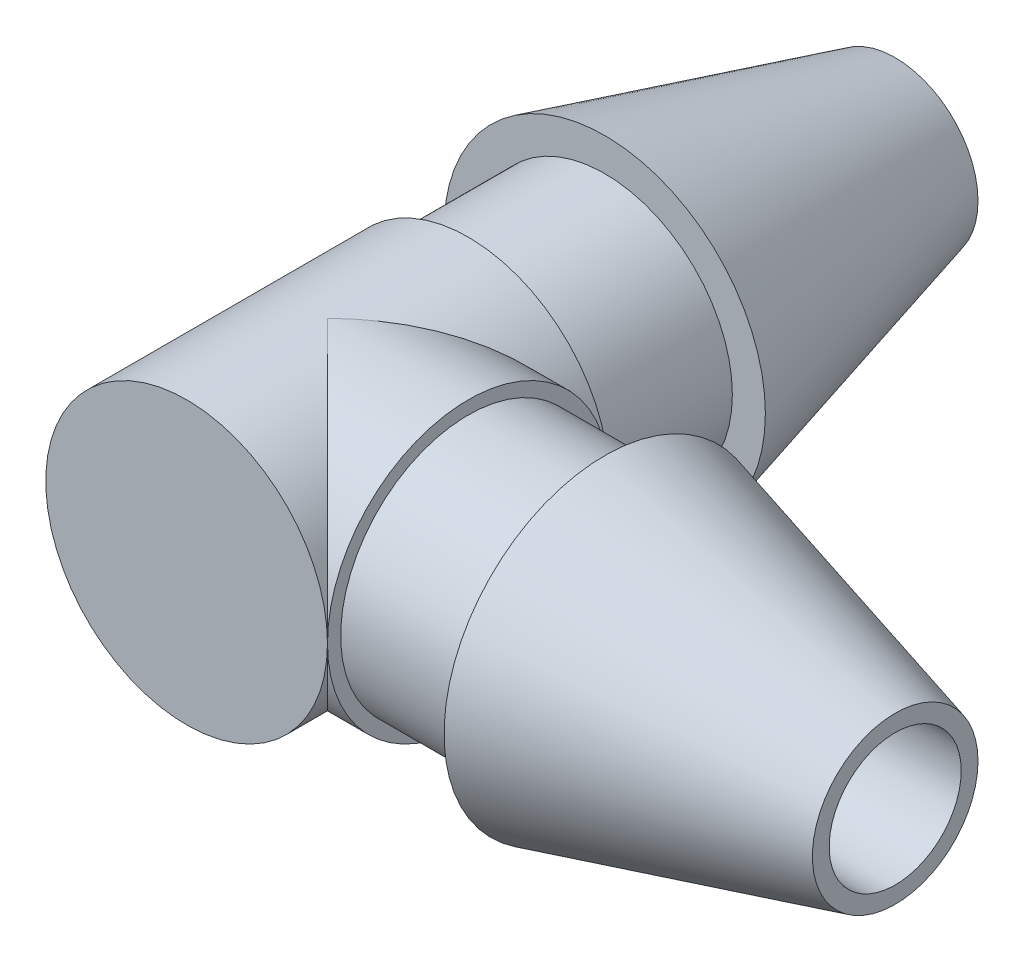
ISO-10303-21;
HEADER;
FILE_DESCRIPTION(('STEP AP214'),'2;1');
FILE_NAME('part.step','',(''),(''),'','','');
FILE_SCHEMA(('AUTOMOTIVE_DESIGN { 1 0 10303 214 1 1 1 1 }'));
ENDSEC;
DATA;
#1=APPLICATION_CONTEXT('core data for automotive mechanical design processes');
#2=APPLICATION_PROTOCOL_DEFINITION('international standard','automotive_design',2000,#1);
#3=PRODUCT_CONTEXT('',#1,'mechanical');
#4=PRODUCT('Part','Part','',(#3));
#5=PRODUCT_RELATED_PRODUCT_CATEGORY('part','',(#4));
#6=PRODUCT_DEFINITION_FORMATION('','',#4);
#7=PRODUCT_DEFINITION_CONTEXT('part definition',#1,'design');
#8=PRODUCT_DEFINITION('design','',#6,#7);
#9=PRODUCT_DEFINITION_SHAPE('','',#8);
#10=(LENGTH_UNIT() NAMED_UNIT(*) SI_UNIT(.MILLI.,.METRE.));
#11=(NAMED_UNIT(*) PLANE_ANGLE_UNIT() SI_UNIT($,.RADIAN.));
#12=(NAMED_UNIT(*) SI_UNIT($,.STERADIAN.) SOLID_ANGLE_UNIT());
#13=UNCERTAINTY_MEASURE_WITH_UNIT(LENGTH_MEASURE(1.E-05),#10,'distance_accuracy_value','');
#14=(GEOMETRIC_REPRESENTATION_CONTEXT(3) GLOBAL_UNCERTAINTY_ASSIGNED_CONTEXT((#13)) GLOBAL_UNIT_ASSIGNED_CONTEXT((#10,
#11,#12)) REPRESENTATION_CONTEXT('',''));
#15=CARTESIAN_POINT('',(0.,0.,0.));
#16=DIRECTION('',(0.,0.,1.));
#17=DIRECTION('',(1.,0.,0.));
#18=AXIS2_PLACEMENT_3D('',#15,#16,#17);
#19=CARTESIAN_POINT('',(0.,0.,-12.9));
#20=DIRECTION('',(0.,0.,1.));
#21=DIRECTION('',(1.,0.,0.));
#22=AXIS2_PLACEMENT_3D('',#19,#20,#21);
#23=CYLINDRICAL_SURFACE('',#22,1.5);
#24=CARTESIAN_POINT('',(0.,0.,-12.9));
#25=DIRECTION('',(0.,0.,1.));
#26=DIRECTION('',(1.,0.,0.));
#27=AXIS2_PLACEMENT_3D('',#24,#25,#26);
#28=CIRCLE('',#27,1.5);
#29=CARTESIAN_POINT('',(1.5,0.,-12.9));
#30=VERTEX_POINT('',#29);
#31=EDGE_CURVE('E239',#30,#30,#28,.T.);
#32=ORIENTED_EDGE('',*,*,#31,.F.);
#33=EDGE_LOOP('',(#32));
#34=FACE_BOUND('',#33,.T.);
#35=CARTESIAN_POINT('',(0.,0.,0.));
#36=DIRECTION('',(-0.894427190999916,0.,0.447213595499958));
#37=DIRECTION('',(0.447213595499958,0.,0.894427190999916));
#38=AXIS2_PLACEMENT_3D('',#35,#36,#37);
#39=ELLIPSE('',#38,3.35410196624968,1.5);
#40=CARTESIAN_POINT('',(0.,1.5,0.));
#41=VERTEX_POINT('',#40);
#42=CARTESIAN_POINT('',(0.45,1.43090880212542,0.9));
#43=VERTEX_POINT('',#42);
#44=EDGE_CURVE('E123',#41,#43,#39,.F.);
#45=ORIENTED_EDGE('',*,*,#44,.T.);
#46=CARTESIAN_POINT('',(0.,0.,0.9));
#47=DIRECTION('',(0.,0.,1.));
#48=DIRECTION('',(1.,0.,0.));
#49=AXIS2_PLACEMENT_3D('',#46,#47,#48);
#50=CIRCLE('',#49,1.5);
#51=CARTESIAN_POINT('',(0.45,-1.43090880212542,0.9));
#52=VERTEX_POINT('',#51);
#53=EDGE_CURVE('E12',#43,#52,#50,.T.);
#54=ORIENTED_EDGE('',*,*,#53,.T.);
#55=CARTESIAN_POINT('',(0.,-1.5,0.));
#56=VERTEX_POINT('',#55);
#57=EDGE_CURVE('E118',#52,#56,#39,.F.);
#58=ORIENTED_EDGE('',*,*,#57,.T.);
#59=CARTESIAN_POINT('',(0.,0.,0.));
#60=DIRECTION('',(-0.894427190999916,0.,-0.447213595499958));
#61=DIRECTION('',(0.447213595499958,0.,-0.894427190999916));
#62=AXIS2_PLACEMENT_3D('',#59,#60,#61);
#63=ELLIPSE('',#62,3.35410196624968,1.5);
#64=EDGE_CURVE('E119',#56,#41,#63,.F.);
#65=ORIENTED_EDGE('',*,*,#64,.T.);
#66=EDGE_LOOP('',(#45,#54,#58,#65));
#67=FACE_BOUND('',#66,.T.);
#68=ADVANCED_FACE('F41',(#34,#67),#23,.F.);
#69=CARTESIAN_POINT('',(0.,1.5,0.));
#70=CARTESIAN_POINT('',(0.,1.5,0.));
#71=CARTESIAN_POINT('',(0.,1.5,0.));
#72=CARTESIAN_POINT('',(0.130694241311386,1.49997370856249,0.0653471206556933));
#73=CARTESIAN_POINT('',(0.0980406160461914,1.50019157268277,0.0980406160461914));
#74=CARTESIAN_POINT('',(0.0653471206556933,1.49997370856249,0.130694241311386));
#75=CARTESIAN_POINT('',(0.261421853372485,1.49572763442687,0.130710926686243));
#76=CARTESIAN_POINT('',(0.196350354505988,1.49145348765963,0.196350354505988));
#77=CARTESIAN_POINT('',(0.130710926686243,1.49572763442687,0.261421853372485));
#78=CARTESIAN_POINT('',(0.520628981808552,1.47867971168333,0.260314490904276));
#79=CARTESIAN_POINT('',(0.389061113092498,1.45737490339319,0.389061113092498));
#80=CARTESIAN_POINT('',(0.260314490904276,1.47867971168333,0.520628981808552));
#81=CARTESIAN_POINT('',(0.64911816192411,1.46595089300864,0.324559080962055));
#82=CARTESIAN_POINT('',(0.484018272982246,1.43198520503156,0.484018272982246));
#83=CARTESIAN_POINT('',(0.324559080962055,1.46595089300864,0.64911816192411));
#84=CARTESIAN_POINT('',(0.901660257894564,1.43211276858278,0.450830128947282));
#85=CARTESIAN_POINT('',(0.666698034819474,1.36555915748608,0.666698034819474));
#86=CARTESIAN_POINT('',(0.450830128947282,1.43211276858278,0.901660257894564));
#87=CARTESIAN_POINT('',(1.02575143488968,1.41114760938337,0.512875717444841));
#88=CARTESIAN_POINT('',(0.754969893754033,1.32442582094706,0.754969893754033));
#89=CARTESIAN_POINT('',(0.512875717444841,1.41114760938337,1.02575143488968));
#90=CARTESIAN_POINT('',(1.26733640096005,1.36111493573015,0.633668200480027));
#91=CARTESIAN_POINT('',(0.921061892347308,1.2286279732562,0.921061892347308));
#92=CARTESIAN_POINT('',(0.633668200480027,1.36111493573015,1.26733640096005));
#93=CARTESIAN_POINT('',(1.38491740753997,1.33225974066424,0.692458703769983));
#94=CARTESIAN_POINT('',(0.999413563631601,1.17381845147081,0.999413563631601));
#95=CARTESIAN_POINT('',(0.692458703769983,1.33225974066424,1.38491740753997));
#96=CARTESIAN_POINT('',(1.61141950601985,1.26687391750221,0.805709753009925));
#97=CARTESIAN_POINT('',(1.14267155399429,1.05375106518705,1.14267155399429));
#98=CARTESIAN_POINT('',(0.805709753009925,1.26687391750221,1.61141950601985));
#99=CARTESIAN_POINT('',(1.72049711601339,1.23061683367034,0.860248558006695));
#100=CARTESIAN_POINT('',(1.20807823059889,0.988305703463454,1.20807823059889));
#101=CARTESIAN_POINT('',(0.860248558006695,1.23061683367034,1.72049711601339));
#102=CARTESIAN_POINT('',(1.92805222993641,1.15098522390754,0.964026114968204));
#103=CARTESIAN_POINT('',(1.32292434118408,0.851319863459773,1.32292434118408));
#104=CARTESIAN_POINT('',(0.964026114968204,1.15098522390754,1.92805222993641));
#105=CARTESIAN_POINT('',(2.02677501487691,1.10793345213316,1.01338750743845));
#106=CARTESIAN_POINT('',(1.37281467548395,0.779561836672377,1.37281467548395));
#107=CARTESIAN_POINT('',(1.01338750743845,1.10793345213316,2.02677501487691));
#108=CARTESIAN_POINT('',(2.21183784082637,1.01540083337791,1.10591892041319));
#109=CARTESIAN_POINT('',(1.45501803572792,0.635692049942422,1.45501803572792));
#110=CARTESIAN_POINT('',(1.10591892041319,1.01540083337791,2.21183784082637));
#111=CARTESIAN_POINT('',(2.29852623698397,0.96627201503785,1.14926311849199));
#112=CARTESIAN_POINT('',(1.48771309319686,0.563355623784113,1.48771309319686));
#113=CARTESIAN_POINT('',(1.14926311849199,0.96627201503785,2.29852623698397));
#114=CARTESIAN_POINT('',(2.45792901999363,0.862400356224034,1.22896450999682));
#115=CARTESIAN_POINT('',(1.53552100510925,0.425305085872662,1.53552100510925));
#116=CARTESIAN_POINT('',(1.22896450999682,0.862400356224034,2.45792901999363));
#117=CARTESIAN_POINT('',(2.53109637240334,0.808009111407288,1.26554818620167));
#118=CARTESIAN_POINT('',(1.55093268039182,0.359391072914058,1.55093268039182));
#119=CARTESIAN_POINT('',(1.26554818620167,0.808009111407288,2.53109637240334));
#120=CARTESIAN_POINT('',(2.66209794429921,0.69455281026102,1.3310489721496));
#121=CARTESIAN_POINT('',(1.56664155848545,0.241488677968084,1.56664155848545));
#122=CARTESIAN_POINT('',(1.3310489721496,0.69455281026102,2.66209794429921));
#123=CARTESIAN_POINT('',(2.72046662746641,0.635800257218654,1.36023331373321));
#124=CARTESIAN_POINT('',(1.56715281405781,0.189356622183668,1.56715281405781));
#125=CARTESIAN_POINT('',(1.36023331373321,0.635800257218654,2.72046662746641));
#126=CARTESIAN_POINT('',(2.82079579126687,0.51468228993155,1.41039789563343));
#127=CARTESIAN_POINT('',(1.55859035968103,0.104507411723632,1.55859035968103));
#128=CARTESIAN_POINT('',(1.41039789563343,0.51468228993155,2.82079579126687));
#129=CARTESIAN_POINT('',(2.86331182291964,0.452550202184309,1.43165591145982));
#130=CARTESIAN_POINT('',(1.54965971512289,0.0717162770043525,1.54965971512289));
#131=CARTESIAN_POINT('',(1.43165591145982,0.452550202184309,2.86331182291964));
#132=CARTESIAN_POINT('',(2.93120825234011,0.325838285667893,1.46560412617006));
#133=CARTESIAN_POINT('',(1.53014285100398,0.0260070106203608,1.53014285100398));
#134=CARTESIAN_POINT('',(1.46560412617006,0.325838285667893,2.93120825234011));
#135=CARTESIAN_POINT('',(2.95706484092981,0.261387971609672,1.4785324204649));
#136=CARTESIAN_POINT('',(1.51964788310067,0.013067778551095,1.51964788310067));
#137=CARTESIAN_POINT('',(1.4785324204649,0.261387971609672,2.95706484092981));
#138=CARTESIAN_POINT('',(2.99132098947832,0.131266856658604,1.49566049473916));
#139=CARTESIAN_POINT('',(1.50455269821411,8.65760121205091E-05,1.50455269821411));
#140=CARTESIAN_POINT('',(1.49566049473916,0.131266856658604,2.99132098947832));
#141=CARTESIAN_POINT('',(3.,0.0656334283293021,1.5));
#142=CARTESIAN_POINT('',(1.5,4.34143246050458E-05,1.5));
#143=CARTESIAN_POINT('',(1.5,0.0656334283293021,3.));
#144=CARTESIAN_POINT('',(3.,-0.0656334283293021,1.5));
#145=CARTESIAN_POINT('',(1.5,-4.34143246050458E-05,1.5));
#146=CARTESIAN_POINT('',(1.5,-0.0656334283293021,3.));
#147=CARTESIAN_POINT('',(2.99132098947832,-0.131266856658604,1.49566049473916));
#148=CARTESIAN_POINT('',(1.50455269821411,-8.65760121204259E-05,1.50455269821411));
#149=CARTESIAN_POINT('',(1.49566049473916,-0.131266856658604,2.99132098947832));
#150=CARTESIAN_POINT('',(2.95706484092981,-0.261387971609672,1.4785324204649));
#151=CARTESIAN_POINT('',(1.51964788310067,-0.0130677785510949,1.51964788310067));
#152=CARTESIAN_POINT('',(1.4785324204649,-0.261387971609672,2.95706484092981));
#153=CARTESIAN_POINT('',(2.93120825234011,-0.325838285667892,1.46560412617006));
#154=CARTESIAN_POINT('',(1.53014285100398,-0.0260070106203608,1.53014285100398));
#155=CARTESIAN_POINT('',(1.46560412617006,-0.325838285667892,2.93120825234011));
#156=CARTESIAN_POINT('',(2.86331182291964,-0.452550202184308,1.43165591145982));
#157=CARTESIAN_POINT('',(1.54965971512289,-0.0717162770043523,1.54965971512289));
#158=CARTESIAN_POINT('',(1.43165591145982,-0.452550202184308,2.86331182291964));
#159=CARTESIAN_POINT('',(2.82079579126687,-0.514682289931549,1.41039789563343));
#160=CARTESIAN_POINT('',(1.55859035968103,-0.104507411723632,1.55859035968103));
#161=CARTESIAN_POINT('',(1.41039789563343,-0.514682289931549,2.82079579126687));
#162=CARTESIAN_POINT('',(2.72046662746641,-0.635800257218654,1.36023331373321));
#163=CARTESIAN_POINT('',(1.56715281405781,-0.189356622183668,1.56715281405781));
#164=CARTESIAN_POINT('',(1.36023331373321,-0.635800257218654,2.72046662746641));
#165=CARTESIAN_POINT('',(2.66209794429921,-0.694552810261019,1.3310489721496));
#166=CARTESIAN_POINT('',(1.56664155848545,-0.241488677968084,1.56664155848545));
#167=CARTESIAN_POINT('',(1.3310489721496,-0.694552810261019,2.66209794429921));
#168=CARTESIAN_POINT('',(2.53109637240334,-0.808009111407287,1.26554818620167));
#169=CARTESIAN_POINT('',(1.55093268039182,-0.359391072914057,1.55093268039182));
#170=CARTESIAN_POINT('',(1.26554818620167,-0.808009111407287,2.53109637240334));
#171=CARTESIAN_POINT('',(2.45792901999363,-0.862400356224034,1.22896450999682));
#172=CARTESIAN_POINT('',(1.53552100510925,-0.425305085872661,1.53552100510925));
#173=CARTESIAN_POINT('',(1.22896450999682,-0.862400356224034,2.45792901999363));
#174=CARTESIAN_POINT('',(2.29852623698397,-0.96627201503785,1.14926311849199));
#175=CARTESIAN_POINT('',(1.48771309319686,-0.563355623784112,1.48771309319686));
#176=CARTESIAN_POINT('',(1.14926311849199,-0.96627201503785,2.29852623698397));
#177=CARTESIAN_POINT('',(2.21183784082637,-1.01540083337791,1.10591892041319));
#178=CARTESIAN_POINT('',(1.45501803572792,-0.635692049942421,1.45501803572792));
#179=CARTESIAN_POINT('',(1.10591892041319,-1.01540083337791,2.21183784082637));
#180=CARTESIAN_POINT('',(2.02677501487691,-1.10793345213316,1.01338750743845));
#181=CARTESIAN_POINT('',(1.37281467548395,-0.779561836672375,1.37281467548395));
#182=CARTESIAN_POINT('',(1.01338750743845,-1.10793345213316,2.02677501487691));
#183=CARTESIAN_POINT('',(1.92805222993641,-1.15098522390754,0.964026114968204));
#184=CARTESIAN_POINT('',(1.32292434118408,-0.851319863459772,1.32292434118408));
#185=CARTESIAN_POINT('',(0.964026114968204,-1.15098522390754,1.92805222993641));
#186=CARTESIAN_POINT('',(1.72049711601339,-1.23061683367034,0.860248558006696));
#187=CARTESIAN_POINT('',(1.20807823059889,-0.988305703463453,1.20807823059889));
#188=CARTESIAN_POINT('',(0.860248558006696,-1.23061683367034,1.72049711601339));
#189=CARTESIAN_POINT('',(1.61141950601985,-1.26687391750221,0.805709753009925));
#190=CARTESIAN_POINT('',(1.14267155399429,-1.05375106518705,1.14267155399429));
#191=CARTESIAN_POINT('',(0.805709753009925,-1.26687391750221,1.61141950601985));
#192=CARTESIAN_POINT('',(1.38491740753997,-1.33225974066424,0.692458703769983));
#193=CARTESIAN_POINT('',(0.999413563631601,-1.17381845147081,0.999413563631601));
#194=CARTESIAN_POINT('',(0.692458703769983,-1.33225974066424,1.38491740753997));
#195=CARTESIAN_POINT('',(1.26733640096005,-1.36111493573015,0.633668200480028));
#196=CARTESIAN_POINT('',(0.921061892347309,-1.2286279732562,0.921061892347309));
#197=CARTESIAN_POINT('',(0.633668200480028,-1.36111493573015,1.26733640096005));
#198=CARTESIAN_POINT('',(1.02575143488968,-1.41114760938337,0.512875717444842));
#199=CARTESIAN_POINT('',(0.754969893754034,-1.32442582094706,0.754969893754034));
#200=CARTESIAN_POINT('',(0.512875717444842,-1.41114760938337,1.02575143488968));
#201=CARTESIAN_POINT('',(0.901660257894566,-1.43211276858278,0.450830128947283));
#202=CARTESIAN_POINT('',(0.666698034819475,-1.36555915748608,0.666698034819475));
#203=CARTESIAN_POINT('',(0.450830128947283,-1.43211276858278,0.901660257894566));
#204=CARTESIAN_POINT('',(0.649118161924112,-1.46595089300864,0.324559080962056));
#205=CARTESIAN_POINT('',(0.484018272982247,-1.43198520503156,0.484018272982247));
#206=CARTESIAN_POINT('',(0.324559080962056,-1.46595089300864,0.649118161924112));
#207=CARTESIAN_POINT('',(0.520628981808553,-1.47867971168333,0.260314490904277));
#208=CARTESIAN_POINT('',(0.389061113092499,-1.45737490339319,0.389061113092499));
#209=CARTESIAN_POINT('',(0.260314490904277,-1.47867971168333,0.520628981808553));
#210=CARTESIAN_POINT('',(0.261421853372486,-1.49572763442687,0.130710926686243));
#211=CARTESIAN_POINT('',(0.196350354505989,-1.49145348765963,0.196350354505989));
#212=CARTESIAN_POINT('',(0.130710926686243,-1.49572763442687,0.261421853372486));
#213=CARTESIAN_POINT('',(0.130694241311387,-1.49997370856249,0.0653471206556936));
#214=CARTESIAN_POINT('',(0.098040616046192,-1.50019157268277,0.098040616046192));
#215=CARTESIAN_POINT('',(0.0653471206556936,-1.49997370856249,0.130694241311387));
#216=CARTESIAN_POINT('',(0.,-1.5,0.));
#217=CARTESIAN_POINT('',(0.,-1.5,0.));
#218=CARTESIAN_POINT('',(0.,-1.5,0.));
#219=(BOUNDED_SURFACE() B_SPLINE_SURFACE(3,2,((#69,#70,#71),(#72,#73,#74),(#75,#76,#77),(#78,
#79,#80),(#81,#82,#83),(#84,#85,#86),(#87,#88,#89),(#90,#91,#92),(#93,#94,#95),(#96,#97,#98),
(#99,#100,#101),(#102,#103,#104),(#105,#106,#107),(#108,#109,#110),(#111,#112,#113),(#114,#115,
#116),(#117,#118,#119),(#120,#121,#122),(#123,#124,#125),(#126,#127,#128),(#129,#130,#131),
(#132,#133,#134),(#135,#136,#137),(#138,#139,#140),(#141,#142,#143),(#144,#145,#146),(#147,#148,
#149),(#150,#151,#152),(#153,#154,#155),(#156,#157,#158),(#159,#160,#161),(#162,#163,#164),
(#165,#166,#167),(#168,#169,#170),(#171,#172,#173),(#174,#175,#176),(#177,#178,#179),(#180,#181,
#182),(#183,#184,#185),(#186,#187,#188),(#189,#190,#191),(#192,#193,#194),(#195,#196,#197),
(#198,#199,#200),(#201,#202,#203),(#204,#205,#206),(#207,#208,#209),(#210,#211,#212),(#213,#214,
#215),(#216,#217,#218)),.UNSPECIFIED.,.F.,.F.,.F.) B_SPLINE_SURFACE_WITH_KNOTS((4,2,2,2,2,2,2,2,
2,2,2,2,2,2,2,2,2,2,2,2,2,2,2,2,4),(3,3),(0.,0.554370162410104,1.10402823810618,
1.64446692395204,2.17159223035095,2.68193910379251,3.17289609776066,3.64293728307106,
4.09185103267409,4.52093889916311,4.9331324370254,5.33294925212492,5.72620643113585,
6.11946361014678,6.51928042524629,6.93147396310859,7.36056182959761,7.80947557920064,
8.27951676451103,8.77047375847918,9.28082063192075,9.80794593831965,10.3483846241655,
10.8980426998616,11.4524128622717),(0.,1.),
.UNSPECIFIED.) GEOMETRIC_REPRESENTATION_ITEM() RATIONAL_B_SPLINE_SURFACE(((1.,1.,1.),(1.,
1.00000566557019,1.),(1.,0.998576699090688,1.),(1.,0.992910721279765,1.),(1.,0.988697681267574,
1.),(1.,0.97761712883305,1.),(1.,0.970795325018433,1.),(1.,0.954789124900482,1.),(1.,
0.945667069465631,1.),(1.,0.92548796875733,1.),(1.,0.914501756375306,1.),(1.,0.891169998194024,
1.),(1.,0.878891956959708,1.),(1.,0.853706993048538,1.),(1.,0.84084914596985,1.),(1.,
0.815387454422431,1.),(1.,0.802798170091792,1.),(1.,0.778880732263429,1.),(1.,0.767521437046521,
1.),(1.,0.747118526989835,1.),(1.,0.738001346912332,1.),(1.,0.723039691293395,1.),(1.,
0.717105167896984,1.),(1.,0.709170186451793,1.),(1.,0.707106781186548,1.),(1.,0.707106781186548,
1.),(1.,0.709170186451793,1.),(1.,0.717105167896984,1.),(1.,0.723039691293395,1.),(1.,
0.738001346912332,1.),(1.,0.747118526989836,1.),(1.,0.767521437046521,1.),(1.,0.778880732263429,
1.),(1.,0.802798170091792,1.),(1.,0.815387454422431,1.),(1.,0.84084914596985,1.),(1.,
0.853706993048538,1.),(1.,0.878891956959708,1.),(1.,0.891169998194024,1.),(1.,0.914501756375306,
1.),(1.,0.92548796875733,1.),(1.,0.945667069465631,1.),(1.,0.954789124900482,1.),(1.,
0.970795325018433,1.),(1.,0.97761712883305,1.),(1.,0.988697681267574,1.),(1.,0.992910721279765,
1.),(1.,0.998576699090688,1.),(1.,1.00000566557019,1.),(1.,1.,1.))) REPRESENTATION_ITEM('') SURFACE());
#220=ORIENTED_EDGE('',*,*,#57,.F.);
#221=CARTESIAN_POINT('',(-0.336481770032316,-1.68822676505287,0.711279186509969));
#222=CARTESIAN_POINT('',(-0.23075899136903,-1.92726011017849,1.5));
#223=CARTESIAN_POINT('',(-0.566853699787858,-1.16736859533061,1.5));
#224=CARTESIAN_POINT('',(-0.273662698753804,-1.66566772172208,0.725661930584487));
#225=CARTESIAN_POINT('',(-0.182849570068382,-1.88227256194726,1.5));
#226=CARTESIAN_POINT('',(-0.499050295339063,-1.13738440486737,1.5));
#227=CARTESIAN_POINT('',(-0.210035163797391,-1.64365684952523,0.740448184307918));
#228=CARTESIAN_POINT('',(-0.131544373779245,-1.83761345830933,1.5));
#229=CARTESIAN_POINT('',(-0.430675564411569,-1.10873437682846,1.5));
#230=CARTESIAN_POINT('',(-0.0814093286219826,-1.60033156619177,0.770711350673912));
#231=CARTESIAN_POINT('',(-0.0246658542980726,-1.75067681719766,1.5));
#232=CARTESIAN_POINT('',(-0.292970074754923,-1.05369342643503,1.5));
#233=CARTESIAN_POINT('',(-0.0164101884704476,-1.57901760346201,0.786188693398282));
#234=CARTESIAN_POINT('',(0.0307831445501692,-1.70831570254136,1.5));
#235=CARTESIAN_POINT('',(-0.223638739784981,-1.02730394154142,1.5));
#236=CARTESIAN_POINT('',(0.115039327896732,-1.53658248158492,0.817796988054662));
#237=CARTESIAN_POINT('',(0.145333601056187,-1.62569589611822,1.5));
#238=CARTESIAN_POINT('',(-0.0838604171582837,-0.97625379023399,1.5));
#239=CARTESIAN_POINT('',(0.181496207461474,-1.51546334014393,0.833931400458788));
#240=CARTESIAN_POINT('',(0.204385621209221,-1.58535596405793,1.5));
#241=CARTESIAN_POINT('',(-0.0134091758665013,-0.951604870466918,1.5));
#242=CARTESIAN_POINT('',(0.315180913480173,-1.47325500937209,0.866638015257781));
#243=CARTESIAN_POINT('',(0.325022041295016,-1.50690471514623,1.5));
#244=CARTESIAN_POINT('',(0.127959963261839,-0.903935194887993,1.5));
#245=CARTESIAN_POINT('',(0.382407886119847,-1.45216581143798,0.883209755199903));
#246=CARTESIAN_POINT('',(0.386556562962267,-1.46871025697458,1.5));
#247=CARTESIAN_POINT('',(0.198877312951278,-0.88091280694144,1.5));
#248=CARTESIAN_POINT('',(0.558962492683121,-1.39664171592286,0.927054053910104));
#249=CARTESIAN_POINT('',(0.548623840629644,-1.37215999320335,1.5));
#250=CARTESIAN_POINT('',(0.384671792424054,-0.822481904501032,1.5));
#251=CARTESIAN_POINT('',(0.668863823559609,-1.36194194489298,0.954665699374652));
#252=CARTESIAN_POINT('',(0.652109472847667,-1.31422305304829,1.5));
#253=CARTESIAN_POINT('',(0.499877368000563,-0.788120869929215,1.5));
#254=CARTESIAN_POINT('',(0.889967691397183,-1.2903588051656,1.01068482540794));
#255=CARTESIAN_POINT('',(0.862684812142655,-1.2020279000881,1.5));
#256=CARTESIAN_POINT('',(0.730996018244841,-0.721768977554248,1.5));
#257=CARTESIAN_POINT('',(1.00117059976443,-1.25347480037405,1.03909253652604));
#258=CARTESIAN_POINT('',(0.969774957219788,-1.14755022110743,1.5));
#259=CARTESIAN_POINT('',(0.846909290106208,-0.689778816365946,1.5));
#260=CARTESIAN_POINT('',(1.22514655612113,-1.17582968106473,1.09662826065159));
#261=CARTESIAN_POINT('',(1.18700343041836,-1.04056251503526,1.5));
#262=CARTESIAN_POINT('',(1.07992561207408,-0.627050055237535,1.5));
#263=CARTESIAN_POINT('',(1.3379251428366,-1.13504364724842,1.12575988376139));
#264=CARTESIAN_POINT('',(1.29725008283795,-0.987896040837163,1.5));
#265=CARTESIAN_POINT('',(1.19703136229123,-0.596321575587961,1.5));
#266=CARTESIAN_POINT('',(1.56374937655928,-1.04795743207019,1.18426593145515));
#267=CARTESIAN_POINT('',(1.51909625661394,-0.883349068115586,1.5));
#268=CARTESIAN_POINT('',(1.43127682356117,-0.535420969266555,1.5));
#269=CARTESIAN_POINT('',(1.67679470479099,-1.00166209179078,1.21364012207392));
#270=CARTESIAN_POINT('',(1.63079836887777,-0.831371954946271,1.5));
#271=CARTESIAN_POINT('',(1.54841641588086,-0.505248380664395,1.5));
#272=CARTESIAN_POINT('',(1.84494403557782,-0.926460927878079,1.25722568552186));
#273=CARTESIAN_POINT('',(1.79891142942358,-0.752339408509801,1.5));
#274=CARTESIAN_POINT('',(1.72280569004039,-0.459797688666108,1.5));
#275=CARTESIAN_POINT('',(1.90018533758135,-0.90073290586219,1.271527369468));
#276=CARTESIAN_POINT('',(1.85383643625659,-0.726395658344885,1.5));
#277=CARTESIAN_POINT('',(1.78012115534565,-0.444773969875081,1.5));
#278=CARTESIAN_POINT('',(2.01047765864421,-0.846706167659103,1.30000863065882));
#279=CARTESIAN_POINT('',(1.96372212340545,-0.673795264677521,1.5));
#280=CARTESIAN_POINT('',(1.89465663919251,-0.414357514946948,1.5));
#281=CARTESIAN_POINT('',(2.06552867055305,-0.818407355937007,1.31418820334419));
#282=CARTESIAN_POINT('',(2.01870607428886,-0.647137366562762,1.5));
#283=CARTESIAN_POINT('',(1.95187665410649,-0.398964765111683,1.5));
#284=CARTESIAN_POINT('',(2.17538957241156,-0.758540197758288,1.34228619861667));
#285=CARTESIAN_POINT('',(2.12871250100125,-0.592641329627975,1.5));
#286=CARTESIAN_POINT('',(2.06634472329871,-0.367515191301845,1.5));
#287=CARTESIAN_POINT('',(2.23019800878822,-0.726961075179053,1.35620357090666));
#288=CARTESIAN_POINT('',(2.18377071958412,-0.564797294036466,1.5));
#289=CARTESIAN_POINT('',(2.12359221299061,-0.351456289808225,1.5));
#290=CARTESIAN_POINT('',(2.31185729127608,-0.676414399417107,1.37668442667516));
#291=CARTESIAN_POINT('',(2.26633174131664,-0.521551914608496,1.5));
#292=CARTESIAN_POINT('',(2.2092420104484,-0.326611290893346,1.5));
#293=CARTESIAN_POINT('',(2.33898378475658,-0.659036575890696,1.38344525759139));
#294=CARTESIAN_POINT('',(2.29372338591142,-0.506960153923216,1.5));
#295=CARTESIAN_POINT('',(2.23775393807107,-0.318203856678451,1.5));
#296=CARTESIAN_POINT('',(2.39294420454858,-0.623139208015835,1.39674232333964));
#297=CARTESIAN_POINT('',(2.34834894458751,-0.477274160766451,1.5));
#298=CARTESIAN_POINT('',(2.2946826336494,-0.301072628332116,1.5));
#299=CARTESIAN_POINT('',(2.41977813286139,-0.604619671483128,1.40327855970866));
#300=CARTESIAN_POINT('',(2.3755909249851,-0.462179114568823,1.5));
#301=CARTESIAN_POINT('',(2.32309940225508,-0.292348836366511,1.5));
#302=CARTESIAN_POINT('',(2.47270232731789,-0.566518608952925,1.41599273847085));
#303=CARTESIAN_POINT('',(2.42947727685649,-0.431574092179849,1.5));
#304=CARTESIAN_POINT('',(2.37939342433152,-0.274644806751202,1.5));
#305=CARTESIAN_POINT('',(2.49879772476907,-0.546956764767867,1.42217454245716));
#306=CARTESIAN_POINT('',(2.45613086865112,-0.416074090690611,1.5));
#307=CARTESIAN_POINT('',(2.40727245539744,-0.265670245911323,1.5));
#308=CARTESIAN_POINT('',(2.55052657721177,-0.506296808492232,1.43419268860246));
#309=CARTESIAN_POINT('',(2.50916313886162,-0.384286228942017,1.5));
#310=CARTESIAN_POINT('',(2.46286744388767,-0.247230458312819,1.5));
#311=CARTESIAN_POINT('',(2.57616004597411,-0.485198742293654,1.44002904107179));
#312=CARTESIAN_POINT('',(2.53555247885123,-0.367997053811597,1.5));
#313=CARTESIAN_POINT('',(2.49058340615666,-0.23776524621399,1.5));
#314=CARTESIAN_POINT('',(2.62671306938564,-0.441634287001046,1.45112143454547));
#315=CARTESIAN_POINT('',(2.58791734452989,-0.334685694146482,1.5));
#316=CARTESIAN_POINT('',(2.54582828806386,-0.218237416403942,1.5));
#317=CARTESIAN_POINT('',(2.65163208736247,-0.419166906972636,1.45637704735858));
#318=CARTESIAN_POINT('',(2.61390897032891,-0.317657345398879,1.5));
#319=CARTESIAN_POINT('',(2.57335705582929,-0.208174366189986,1.5));
#320=CARTESIAN_POINT('',(2.68839538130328,-0.384153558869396,1.46379361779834));
#321=CARTESIAN_POINT('',(2.65255386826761,-0.291327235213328,1.5));
#322=CARTESIAN_POINT('',(2.61444246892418,-0.192535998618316,1.5));
#323=CARTESIAN_POINT('',(2.70054701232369,-0.37226400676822,1.46618795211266));
#324=CARTESIAN_POINT('',(2.66536069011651,-0.282432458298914,1.5));
#325=CARTESIAN_POINT('',(2.62810268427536,-0.187232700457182,1.5));
#326=CARTESIAN_POINT('',(2.72460565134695,-0.348013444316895,1.47079398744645));
#327=CARTESIAN_POINT('',(2.6908207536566,-0.264353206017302,1.5));
#328=CARTESIAN_POINT('',(2.6553363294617,-0.176408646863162,1.5));
#329=CARTESIAN_POINT('',(2.73651266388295,-0.335652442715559,1.47300569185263));
#330=CARTESIAN_POINT('',(2.70347635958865,-0.255167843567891,1.5));
#331=CARTESIAN_POINT('',(2.66890976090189,-0.170887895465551,1.5));
#332=CARTESIAN_POINT('',(2.77160030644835,-0.298405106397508,1.47922315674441));
#333=CARTESIAN_POINT('',(2.74096187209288,-0.227505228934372,1.5));
#334=CARTESIAN_POINT('',(2.70932800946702,-0.15404798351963,1.5));
#335=CARTESIAN_POINT('',(2.79429448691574,-0.273211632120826,1.48284211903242));
#336=CARTESIAN_POINT('',(2.76554841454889,-0.208756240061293,1.5));
#337=CARTESIAN_POINT('',(2.73603331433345,-0.142389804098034,1.5));
#338=CARTESIAN_POINT('',(2.82735466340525,-0.234596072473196,1.48753190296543));
#339=CARTESIAN_POINT('',(2.80181468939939,-0.179957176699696,1.5));
#340=CARTESIAN_POINT('',(2.77575186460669,-0.124155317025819,1.5));
#341=CARTESIAN_POINT('',(2.83821296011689,-0.221584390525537,1.48897223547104));
#342=CARTESIAN_POINT('',(2.81379546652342,-0.17025010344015,1.5));
#343=CARTESIAN_POINT('',(2.78893701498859,-0.117951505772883,1.5));
#344=CARTESIAN_POINT('',(2.85957986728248,-0.195159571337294,1.49160547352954));
#345=CARTESIAN_POINT('',(2.83752060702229,-0.150523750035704,1.5));
#346=CARTESIAN_POINT('',(2.81516415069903,-0.105251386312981,1.5));
#347=CARTESIAN_POINT('',(2.87008851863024,-0.181746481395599,1.49279840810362));
#348=CARTESIAN_POINT('',(2.84926773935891,-0.140502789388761,1.5));
#349=CARTESIAN_POINT('',(2.82820615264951,-0.0987551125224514,1.5));
#350=CARTESIAN_POINT('',(2.90094914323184,-0.141587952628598,1.49592277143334));
#351=CARTESIAN_POINT('',(2.88402550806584,-0.110302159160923,1.5));
#352=CARTESIAN_POINT('',(2.86703692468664,-0.0787911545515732,1.5));
#353=CARTESIAN_POINT('',(2.92067201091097,-0.114879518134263,1.49740510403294));
#354=CARTESIAN_POINT('',(2.90664126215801,-0.0899118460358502,1.5));
#355=CARTESIAN_POINT('',(2.89257369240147,-0.064828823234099,1.5));
#356=CARTESIAN_POINT('',(2.94915867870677,-0.0748984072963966,1.49889619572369));
#357=CARTESIAN_POINT('',(2.93976893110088,-0.0589749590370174,1.5));
#358=CARTESIAN_POINT('',(2.93036746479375,-0.0430203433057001,1.5));
#359=CARTESIAN_POINT('',(2.95846984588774,-0.0615871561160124,1.49927115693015));
#360=CARTESIAN_POINT('',(2.95067721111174,-0.0486059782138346,1.5));
#361=CARTESIAN_POINT('',(2.94287813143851,-0.0356079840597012,1.5));
#362=CARTESIAN_POINT('',(2.97216811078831,-0.041614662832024,1.49966355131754));
#363=CARTESIAN_POINT('',(2.96683835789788,-0.0329430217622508,1.5));
#364=CARTESIAN_POINT('',(2.96150639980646,-0.0242662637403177,1.5));
#365=CARTESIAN_POINT('',(2.97668897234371,-0.0349569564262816,1.49976600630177));
#366=CARTESIAN_POINT('',(2.9721912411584,-0.0277044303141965,1.5));
#367=CARTESIAN_POINT('',(2.96769219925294,-0.0204489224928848,1.5));
#368=CARTESIAN_POINT('',(2.98341221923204,-0.0249977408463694,1.49987874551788));
#369=CARTESIAN_POINT('',(2.98017980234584,-0.019841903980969,1.5));
#370=CARTESIAN_POINT('',(2.97694683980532,-0.0146849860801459,1.5));
#371=CARTESIAN_POINT('',(2.98564350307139,-0.0216827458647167,1.49990950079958));
#372=CARTESIAN_POINT('',(2.98283569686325,-0.0172204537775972,1.5));
#373=CARTESIAN_POINT('',(2.98002753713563,-0.0127574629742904,1.5));
#374=CARTESIAN_POINT('',(2.9889654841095,-0.0166773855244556,1.49994584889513));
#375=CARTESIAN_POINT('',(2.98679659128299,-0.0132554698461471,1.5));
#376=CARTESIAN_POINT('',(2.98462752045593,-0.00983323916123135,1.5));
#377=CARTESIAN_POINT('',(2.99006861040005,-0.0150035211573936,1.49995633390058));
#378=CARTESIAN_POINT('',(2.98811300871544,-0.0119283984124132,1.5));
#379=CARTESIAN_POINT('',(2.98615727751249,-0.0088530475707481,1.5));
#380=CARTESIAN_POINT('',(2.99228633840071,-0.011719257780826,1.49997357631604));
#381=CARTESIAN_POINT('',(2.99076208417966,-0.0093226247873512,1.5));
#382=CARTESIAN_POINT('',(2.98923777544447,-0.00692588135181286,1.5));
#383=CARTESIAN_POINT('',(2.9934009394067,-0.0101088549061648,1.4999803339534));
#384=CARTESIAN_POINT('',(2.99209474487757,-0.00804391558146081,1.5));
#385=CARTESIAN_POINT('',(2.99078851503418,-0.00597890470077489,1.5));
#386=CARTESIAN_POINT('',(2.99542188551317,-0.00704807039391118,1.49999040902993));
#387=CARTESIAN_POINT('',(2.99451282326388,-0.00561123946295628,1.5));
#388=CARTESIAN_POINT('',(2.99360375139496,-0.00417438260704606,1.5));
#389=CARTESIAN_POINT('',(2.9963331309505,-0.00561304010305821,1.4999941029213));
#390=CARTESIAN_POINT('',(2.99560382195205,-0.00446983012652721,1.5));
#391=CARTESIAN_POINT('',(2.99487450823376,-0.00332660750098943,1.5));
#392=CARTESIAN_POINT('',(2.99815816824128,-0.00276544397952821,1.49999904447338));
#393=CARTESIAN_POINT('',(2.99779053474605,-0.0022033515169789,1.5));
#394=CARTESIAN_POINT('',(2.99742290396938,-0.00164125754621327,1.5));
#395=CARTESIAN_POINT('',(2.9990719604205,-0.00135288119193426,1.50000029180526));
#396=CARTESIAN_POINT('',(2.99888625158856,-0.0010782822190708,1.5));
#397=CARTESIAN_POINT('',(2.99870054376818,-0.000803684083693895,1.5));
#398=CARTESIAN_POINT('',(3.,-1.92558404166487E-08,1.5));
#399=CARTESIAN_POINT('',(3.,-9.62792020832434E-09,1.5));
#400=CARTESIAN_POINT('',(3.,0.,1.5));
#401=(BOUNDED_SURFACE() B_SPLINE_SURFACE(3,2,((#221,#222,#223),(#224,#225,#226),(#227,#228,
#229),(#230,#231,#232),(#233,#234,#235),(#236,#237,#238),(#239,#240,#241),(#242,#243,#244),
(#245,#246,#247),(#248,#249,#250),(#251,#252,#253),(#254,#255,#256),(#257,#258,#259),(#260,#261,
#262),(#263,#264,#265),(#266,#267,#268),(#269,#270,#271),(#272,#273,#274),(#275,#276,#277),
(#278,#279,#280),(#281,#282,#283),(#284,#285,#286),(#287,#288,#289),(#290,#291,#292),(#293,#294,
#295),(#296,#297,#298),(#299,#300,#301),(#302,#303,#304),(#305,#306,#307),(#308,#309,#310),
(#311,#312,#313),(#314,#315,#316),(#317,#318,#319),(#320,#321,#322),(#323,#324,#325),(#326,#327,
#328),(#329,#330,#331),(#332,#333,#334),(#335,#336,#337),(#338,#339,#340),(#341,#342,#343),
(#344,#345,#346),(#347,#348,#349),(#350,#351,#352),(#353,#354,#355),(#356,#357,#358),(#359,#360,
#361),(#362,#363,#364),(#365,#366,#367),(#368,#369,#370),(#371,#372,#373),(#374,#375,#376),
(#377,#378,#379),(#380,#381,#382),(#383,#384,#385),(#386,#387,#388),(#389,#390,#391),(#392,#393,
#394),(#395,#396,#397),(#398,#399,#400)),.UNSPECIFIED.,.F.,.F.,
.F.) B_SPLINE_SURFACE_WITH_KNOTS((4,2,2,2,2,2,2,2,2,2,2,2,2,2,2,2,2,2,2,2,2,2,2,2,2,2,2,2,2,4),
(3,3),(0.,0.22237331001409,0.444886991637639,0.668781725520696,0.892448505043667,
1.25306860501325,1.61379424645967,1.97700068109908,2.33989028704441,2.51764493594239,
2.69540619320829,2.8737710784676,2.96294662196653,3.05212155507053,3.1399818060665,
3.22783943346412,3.31576141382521,3.35972046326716,3.40367869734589,3.49107421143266,
3.53478675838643,3.57849417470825,3.66576688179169,3.70938880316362,3.73119500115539,
3.74209687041,3.74754737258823,3.75299754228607,3.75757986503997,3.7621628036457),(0.,1.),
.UNSPECIFIED.) GEOMETRIC_REPRESENTATION_ITEM() RATIONAL_B_SPLINE_SURFACE(((1.,0.585430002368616,
1.),(1.,0.595671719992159,1.),(1.,0.605925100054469,1.),(1.,0.626389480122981,1.),(1.,
0.636600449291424,1.),(1.,0.656964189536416,1.),(1.,0.667116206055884,1.),(1.,0.687240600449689,
1.),(1.,0.697213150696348,1.),(1.,0.723048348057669,1.),(1.,0.738778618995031,1.),(1.,
0.769725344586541,1.),(1.,0.784941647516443,1.),(1.,0.814912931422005,1.),(1.,0.829664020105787,
1.),(1.,0.858543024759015,1.),(1.,0.872671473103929,1.),(1.,0.893159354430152,1.),(1.,
0.899805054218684,1.),(1.,0.912898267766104,1.),(1.,0.919345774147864,1.),(1.,0.931993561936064,
1.),(1.,0.938192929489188,1.),(1.,0.947230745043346,1.),(1.,0.950199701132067,1.),(1.,
0.956012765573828,1.),(1.,0.958856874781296,1.),(1.,0.964365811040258,1.),(1.,0.96703266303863,
1.),(1.,0.972197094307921,1.),(1.,0.974694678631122,1.),(1.,0.979425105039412,1.),(1.,
0.981657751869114,1.),(1.,0.984799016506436,1.),(1.,0.985811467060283,1.),(1.,0.987756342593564,
1.),(1.,0.988688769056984,1.),(1.,0.991306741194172,1.),(1.,0.992826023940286,1.),(1.,
0.994791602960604,1.),(1.,0.995394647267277,1.),(1.,0.996496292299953,1.),(1.,0.996994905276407,
1.),(1.,0.998300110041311,1.),(1.,0.998918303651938,1.),(1.,0.999539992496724,1.),(1.,
0.999696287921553,1.),(1.,0.999859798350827,1.),(1.,0.999902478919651,1.),(1.,0.999949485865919,
1.),(1.,0.999962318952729,1.),(1.,0.999977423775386,1.),(1.,0.999981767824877,1.),(1.,
0.999989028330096,1.),(1.,0.999991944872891,1.),(1.,0.999996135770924,1.),(1.,0.999997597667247,
1.),(1.,0.999999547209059,1.),(1.,1.00000003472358,1.),(1.,1.,1.))) REPRESENTATION_ITEM('') SURFACE());
#402=CARTESIAN_POINT('',(-0.336481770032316,-1.68822676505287,0.711279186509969));
#403=CARTESIAN_POINT('',(-0.273662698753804,-1.66566772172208,0.725661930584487));
#404=CARTESIAN_POINT('',(-0.210035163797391,-1.64365684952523,0.740448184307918));
#405=CARTESIAN_POINT('',(-0.0814093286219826,-1.60033156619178,0.770711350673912));
#406=CARTESIAN_POINT('',(-0.0164101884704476,-1.57901760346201,0.786188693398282));
#407=CARTESIAN_POINT('',(0.115039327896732,-1.53658248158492,0.817796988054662));
#408=CARTESIAN_POINT('',(0.181496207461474,-1.51546334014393,0.833931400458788));
#409=CARTESIAN_POINT('',(0.315180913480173,-1.47325500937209,0.866638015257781));
#410=CARTESIAN_POINT('',(0.382407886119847,-1.45216581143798,0.883209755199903));
#411=CARTESIAN_POINT('',(0.558962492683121,-1.39664171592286,0.927054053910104));
#412=CARTESIAN_POINT('',(0.668863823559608,-1.36194194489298,0.954665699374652));
#413=CARTESIAN_POINT('',(0.889967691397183,-1.2903588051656,1.01068482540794));
#414=CARTESIAN_POINT('',(1.00117059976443,-1.25347480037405,1.03909253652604));
#415=CARTESIAN_POINT('',(1.22514655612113,-1.17582968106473,1.09662826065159));
#416=CARTESIAN_POINT('',(1.3379251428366,-1.13504364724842,1.12575988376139));
#417=CARTESIAN_POINT('',(1.56374937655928,-1.04795743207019,1.18426593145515));
#418=CARTESIAN_POINT('',(1.67679470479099,-1.00166209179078,1.21364012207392));
#419=CARTESIAN_POINT('',(1.84494403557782,-0.926460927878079,1.25722568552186));
#420=CARTESIAN_POINT('',(1.90018533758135,-0.90073290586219,1.271527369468));
#421=CARTESIAN_POINT('',(2.01047765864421,-0.846706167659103,1.30000863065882));
#422=CARTESIAN_POINT('',(2.06552867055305,-0.818407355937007,1.31418820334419));
#423=CARTESIAN_POINT('',(2.17538957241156,-0.758540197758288,1.34228619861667));
#424=CARTESIAN_POINT('',(2.23019800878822,-0.726961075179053,1.35620357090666));
#425=CARTESIAN_POINT('',(2.31185729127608,-0.676414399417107,1.37668442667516));
#426=CARTESIAN_POINT('',(2.33898378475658,-0.659036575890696,1.38344525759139));
#427=CARTESIAN_POINT('',(2.39294420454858,-0.623139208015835,1.39674232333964));
#428=CARTESIAN_POINT('',(2.41977813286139,-0.604619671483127,1.40327855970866));
#429=CARTESIAN_POINT('',(2.47270232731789,-0.566518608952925,1.41599273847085));
#430=CARTESIAN_POINT('',(2.49879772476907,-0.546956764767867,1.42217454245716));
#431=CARTESIAN_POINT('',(2.55052657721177,-0.506296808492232,1.43419268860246));
#432=CARTESIAN_POINT('',(2.57616004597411,-0.485198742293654,1.44002904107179));
#433=CARTESIAN_POINT('',(2.62671306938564,-0.441634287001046,1.45112143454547));
#434=CARTESIAN_POINT('',(2.65163208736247,-0.419166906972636,1.45637704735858));
#435=CARTESIAN_POINT('',(2.68839538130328,-0.384153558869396,1.46379361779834));
#436=CARTESIAN_POINT('',(2.70054701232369,-0.37226400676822,1.46618795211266));
#437=CARTESIAN_POINT('',(2.72460565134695,-0.348013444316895,1.47079398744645));
#438=CARTESIAN_POINT('',(2.73651266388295,-0.335652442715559,1.47300569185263));
#439=CARTESIAN_POINT('',(2.77160030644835,-0.298405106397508,1.47922315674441));
#440=CARTESIAN_POINT('',(2.79429448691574,-0.273211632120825,1.48284211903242));
#441=CARTESIAN_POINT('',(2.82735466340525,-0.234596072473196,1.48753190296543));
#442=CARTESIAN_POINT('',(2.83821296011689,-0.221584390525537,1.48897223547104));
#443=CARTESIAN_POINT('',(2.85957986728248,-0.195159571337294,1.49160547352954));
#444=CARTESIAN_POINT('',(2.87008851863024,-0.181746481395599,1.49279840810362));
#445=CARTESIAN_POINT('',(2.90094914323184,-0.141587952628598,1.49592277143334));
#446=CARTESIAN_POINT('',(2.92067201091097,-0.114879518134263,1.49740510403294));
#447=CARTESIAN_POINT('',(2.94915867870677,-0.0748984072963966,1.49889619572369));
#448=CARTESIAN_POINT('',(2.95846984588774,-0.0615871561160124,1.49927115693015));
#449=CARTESIAN_POINT('',(2.97216811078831,-0.041614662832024,1.49966355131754));
#450=CARTESIAN_POINT('',(2.97668897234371,-0.0349569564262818,1.49976600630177));
#451=CARTESIAN_POINT('',(2.98341221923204,-0.0249977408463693,1.49987874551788));
#452=CARTESIAN_POINT('',(2.98564350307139,-0.0216827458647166,1.49990950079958));
#453=CARTESIAN_POINT('',(2.9889654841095,-0.0166773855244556,1.49994584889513));
#454=CARTESIAN_POINT('',(2.99006861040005,-0.0150035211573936,1.49995633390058));
#455=CARTESIAN_POINT('',(2.99228633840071,-0.011719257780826,1.49997357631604));
#456=CARTESIAN_POINT('',(2.9934009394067,-0.0101088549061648,1.4999803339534));
#457=CARTESIAN_POINT('',(2.99542188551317,-0.00704807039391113,1.49999040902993));
#458=CARTESIAN_POINT('',(2.9963331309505,-0.00561304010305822,1.4999941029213));
#459=CARTESIAN_POINT('',(2.99815816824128,-0.00276544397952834,1.49999904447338));
#460=CARTESIAN_POINT('',(2.9990719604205,-0.00135288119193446,1.50000029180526));
#461=CARTESIAN_POINT('',(3.,-1.92558404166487E-08,1.5));
#462=B_SPLINE_CURVE_WITH_KNOTS('',3,(#402,#403,#404,#405,#406,#407,#408,#409,#410,#411,#412,
#413,#414,#415,#416,#417,#418,#419,#420,#421,#422,#423,#424,#425,#426,#427,#428,#429,#430,#431,
#432,#433,#434,#435,#436,#437,#438,#439,#440,#441,#442,#443,#444,#445,#446,#447,#448,#449,#450,
#451,#452,#453,#454,#455,#456,#457,#458,#459,#460,#461),.UNSPECIFIED.,.F.,.F.,(4,2,2,2,2,2,2,2,
2,2,2,2,2,2,2,2,2,2,2,2,2,2,2,2,2,2,2,2,2,4),(0.,0.22237331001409,0.444886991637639,
0.668781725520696,0.892448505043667,1.25306860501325,1.61379424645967,1.97700068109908,
2.33989028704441,2.51764493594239,2.69540619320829,2.8737710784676,2.96294662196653,
3.05212155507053,3.1399818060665,3.22783943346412,3.31576141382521,3.35972046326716,
3.40367869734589,3.49107421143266,3.53478675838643,3.57849417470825,3.66576688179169,
3.70938880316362,3.73119500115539,3.74209687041,3.74754737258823,3.75299754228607,
3.75757986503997,3.7621628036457),.UNSPECIFIED.);
#463=CARTESIAN_POINT('',(3.,0.,1.5));
#464=VERTEX_POINT('',#463);
#465=EDGE_CURVE('E102',#52,#464,#462,.T.);
#466=ORIENTED_EDGE('',*,*,#465,.T.);
#467=CARTESIAN_POINT('',(0.,0.,0.));
#468=DIRECTION('',(-0.447213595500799,0.,0.894427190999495));
#469=DIRECTION('',(0.894427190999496,0.,0.447213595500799));
#470=AXIS2_PLACEMENT_3D('',#467,#468,#469);
#471=ELLIPSE('',#470,3.35410196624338,1.5);
#472=EDGE_CURVE('E117',#56,#464,#471,.T.);
#473=ORIENTED_EDGE('',*,*,#472,.F.);
#474=EDGE_LOOP('',(#220,#466,#473));
#475=FACE_BOUND('',#474,.T.);
#476=ADVANCED_FACE('F115',(#475),#219,.T.);
#477=EDGE_CURVE('E121',#464,#41,#471,.T.);
#478=ORIENTED_EDGE('',*,*,#477,.F.);
#479=CARTESIAN_POINT('',(-0.472553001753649,1.12665444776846,1.5));
#480=CARTESIAN_POINT('',(-0.161582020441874,1.86459136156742,1.5));
#481=CARTESIAN_POINT('',(-0.24893767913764,1.65729560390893,0.731461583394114));
#482=CARTESIAN_POINT('',(-0.411721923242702,1.10102333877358,1.5));
#483=CARTESIAN_POINT('',(-0.116821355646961,1.82537709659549,1.5));
#484=CARTESIAN_POINT('',(-0.19235845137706,1.63763014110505,0.744587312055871));
#485=CARTESIAN_POINT('',(-0.350489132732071,1.07636962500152,1.5));
#486=CARTESIAN_POINT('',(-0.0695543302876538,1.78646593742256,1.5));
#487=CARTESIAN_POINT('',(-0.135196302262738,1.61832089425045,0.758010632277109));
#488=CARTESIAN_POINT('',(-0.227377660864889,1.02875965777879,1.5));
#489=CARTESIAN_POINT('',(0.0280400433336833,1.7105419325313,1.5));
#490=CARTESIAN_POINT('',(-0.0199087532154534,1.58015837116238,0.785360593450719));
#491=CARTESIAN_POINT('',(-0.165499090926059,1.00580311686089,1.5));
#492=CARTESIAN_POINT('',(0.0782891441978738,1.67346870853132,1.5));
#493=CARTESIAN_POINT('',(0.0382164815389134,1.56130501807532,0.799287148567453));
#494=CARTESIAN_POINT('',(-0.0415768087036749,0.961444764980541,1.5));
#495=CARTESIAN_POINT('',(0.180964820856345,1.60134148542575,1.5));
#496=CARTESIAN_POINT('',(0.154923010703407,1.52389515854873,0.82747798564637));
#497=CARTESIAN_POINT('',(0.0204640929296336,0.94003505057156,1.5));
#498=CARTESIAN_POINT('',(0.233321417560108,1.56622325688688,1.5));
#499=CARTESIAN_POINT('',(0.213499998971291,1.50533758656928,0.841739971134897));
#500=CARTESIAN_POINT('',(0.144950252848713,0.898429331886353,1.5));
#501=CARTESIAN_POINT('',(0.339975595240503,1.49764814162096,1.5));
#502=CARTESIAN_POINT('',(0.331286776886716,1.46820110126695,0.870607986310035));
#503=CARTESIAN_POINT('',(0.207395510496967,0.878233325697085,1.5));
#504=CARTESIAN_POINT('',(0.394244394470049,1.46413615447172,1.5));
#505=CARTESIAN_POINT('',(0.390496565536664,1.44962218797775,0.885214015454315));
#506=CARTESIAN_POINT('',(0.340630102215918,0.836333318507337,1.5));
#507=CARTESIAN_POINT('',(0.511267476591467,1.3944082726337,1.5));
#508=CARTESIAN_POINT('',(0.517117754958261,1.40980115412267,0.916667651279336));
#509=CARTESIAN_POINT('',(0.411462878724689,0.814767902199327,1.5));
#510=CARTESIAN_POINT('',(0.574398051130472,1.35821270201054,1.5));
#511=CARTESIAN_POINT('',(0.584607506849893,1.3885229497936,0.933562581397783));
#512=CARTESIAN_POINT('',(0.553452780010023,0.772682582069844,1.5));
#513=CARTESIAN_POINT('',(0.702225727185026,1.28740563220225,1.5));
#514=CARTESIAN_POINT('',(0.720125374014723,1.34534736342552,0.967659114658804));
#515=CARTESIAN_POINT('',(0.624609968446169,0.752162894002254,1.5));
#516=CARTESIAN_POINT('',(0.766918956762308,1.25273414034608,1.5));
#517=CARTESIAN_POINT('',(0.788153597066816,1.32344985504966,0.984860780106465));
#518=CARTESIAN_POINT('',(0.76762724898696,0.711810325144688,1.5));
#519=CARTESIAN_POINT('',(0.897992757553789,1.1843664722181,1.5));
#520=CARTESIAN_POINT('',(0.925140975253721,1.27853916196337,1.01969292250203));
#521=CARTESIAN_POINT('',(0.839488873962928,0.691982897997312,1.5));
#522=CARTESIAN_POINT('',(0.96439188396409,1.15062745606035,1.5));
#523=CARTESIAN_POINT('',(0.994103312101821,1.25551954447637,1.03732548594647));
#524=CARTESIAN_POINT('',(0.983319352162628,0.652959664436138,1.5));
#525=CARTESIAN_POINT('',(1.09807960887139,1.08415227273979,1.5));
#526=CARTESIAN_POINT('',(1.13227150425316,1.20821509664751,1.07275774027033));
#527=CARTESIAN_POINT('',(1.0552880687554,0.633763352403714,1.5));
#528=CARTESIAN_POINT('',(1.16538287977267,1.05137454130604,1.5));
#529=CARTESIAN_POINT('',(1.20147711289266,1.18393132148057,1.09055728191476));
#530=CARTESIAN_POINT('',(1.20720693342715,0.593688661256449,1.5));
#531=CARTESIAN_POINT('',(1.30796740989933,0.982913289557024,1.5));
#532=CARTESIAN_POINT('',(1.34771998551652,1.13089835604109,1.12828669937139));
#533=CARTESIAN_POINT('',(1.28716907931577,0.572855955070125,1.5));
#534=CARTESIAN_POINT('',(1.38353083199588,0.947175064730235,1.5));
#535=CARTESIAN_POINT('',(1.42478592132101,1.10195126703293,1.14823664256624));
#536=CARTESIAN_POINT('',(1.44714142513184,0.531356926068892,1.5));
#537=CARTESIAN_POINT('',(1.53529212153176,0.875872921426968,1.5));
#538=CARTESIAN_POINT('',(1.57905550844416,1.04127352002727,1.18824014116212));
#539=CARTESIAN_POINT('',(1.52715162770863,0.510690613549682,1.5));
#540=CARTESIAN_POINT('',(1.61152645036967,0.840281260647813,1.5));
#541=CARTESIAN_POINT('',(1.65625916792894,1.00954269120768,1.20829370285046));
#542=CARTESIAN_POINT('',(1.6874849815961,0.469052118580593,1.5));
#543=CARTESIAN_POINT('',(1.764661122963,0.768511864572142,1.5));
#544=CARTESIAN_POINT('',(1.81089697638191,0.942299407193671,1.24840772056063));
#545=CARTESIAN_POINT('',(1.76780788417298,0.448078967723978,1.5));
#546=CARTESIAN_POINT('',(1.84162330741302,0.732309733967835,1.5));
#547=CARTESIAN_POINT('',(1.88833055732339,0.906770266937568,1.26846778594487));
#548=CARTESIAN_POINT('',(1.88813743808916,0.416068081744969,1.5));
#549=CARTESIAN_POINT('',(1.95767931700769,0.67664614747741,1.5));
#550=CARTESIAN_POINT('',(2.00420132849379,0.849640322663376,1.29838887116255));
#551=CARTESIAN_POINT('',(1.92821725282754,0.405307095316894,1.5));
#552=CARTESIAN_POINT('',(1.99618166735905,0.658007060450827,1.5));
#553=CARTESIAN_POINT('',(2.04277424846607,0.829959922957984,1.30833335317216));
#554=CARTESIAN_POINT('',(2.00830277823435,0.383513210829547,1.5));
#555=CARTESIAN_POINT('',(2.07312134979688,0.620263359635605,1.5));
#556=CARTESIAN_POINT('',(2.11971108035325,0.789146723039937,1.32806623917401));
#557=CARTESIAN_POINT('',(2.04830848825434,0.372480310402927,1.5));
#558=CARTESIAN_POINT('',(2.11157051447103,0.601157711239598,1.5));
#559=CARTESIAN_POINT('',(2.15807499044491,0.768013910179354,1.33785464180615));
#560=CARTESIAN_POINT('',(2.16682699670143,0.339194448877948,1.5));
#561=CARTESIAN_POINT('',(2.22498987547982,0.543702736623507,1.5));
#562=CARTESIAN_POINT('',(2.2715266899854,0.702659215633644,1.36665026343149));
#563=CARTESIAN_POINT('',(2.24519263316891,0.316401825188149,1.5));
#564=CARTESIAN_POINT('',(2.30041167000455,0.504097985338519,1.5));
#565=CARTESIAN_POINT('',(2.34627727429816,0.655859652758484,1.38542539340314));
#566=CARTESIAN_POINT('',(2.36216997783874,0.28018181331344,1.5));
#567=CARTESIAN_POINT('',(2.4129377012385,0.441171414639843,1.5));
#568=CARTESIAN_POINT('',(2.45658093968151,0.578571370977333,1.41217381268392));
#569=CARTESIAN_POINT('',(2.40109115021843,0.26776164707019,1.5));
#570=CARTESIAN_POINT('',(2.45017510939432,0.419718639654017,1.5));
#571=CARTESIAN_POINT('',(2.49306714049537,0.551608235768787,1.42085917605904));
#572=CARTESIAN_POINT('',(2.45923433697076,0.248411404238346,1.5));
#573=CARTESIAN_POINT('',(2.50572969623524,0.386300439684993,1.5));
#574=CARTESIAN_POINT('',(2.54713402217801,0.508876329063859,1.43339521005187));
#575=CARTESIAN_POINT('',(2.47857597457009,0.241841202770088,1.5));
#576=CARTESIAN_POINT('',(2.52415190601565,0.374984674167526,1.5));
#577=CARTESIAN_POINT('',(2.56504622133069,0.494250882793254,1.43749195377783));
#578=CARTESIAN_POINT('',(2.51716288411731,0.228423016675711,1.5));
#579=CARTESIAN_POINT('',(2.56079646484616,0.352014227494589,1.5));
#580=CARTESIAN_POINT('',(2.60052744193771,0.464354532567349,1.44541109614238));
#581=CARTESIAN_POINT('',(2.53640815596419,0.221575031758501,1.5));
#582=CARTESIAN_POINT('',(2.5790242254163,0.340357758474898,1.5));
#583=CARTESIAN_POINT('',(2.61809646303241,0.449083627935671,1.44923349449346));
#584=CARTESIAN_POINT('',(2.57462229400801,0.207628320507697,1.5));
#585=CARTESIAN_POINT('',(2.61510462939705,0.316741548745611,1.5));
#586=CARTESIAN_POINT('',(2.65271712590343,0.417948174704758,1.45655834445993));
#587=CARTESIAN_POINT('',(2.59359211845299,0.200532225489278,1.5));
#588=CARTESIAN_POINT('',(2.63296404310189,0.304783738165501,1.5));
#589=CARTESIAN_POINT('',(2.6697718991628,0.402089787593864,1.4600632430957));
#590=CARTESIAN_POINT('',(2.63139101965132,0.18597239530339,1.5));
#591=CARTESIAN_POINT('',(2.66843883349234,0.280311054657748,1.5));
#592=CARTESIAN_POINT('',(2.70349142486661,0.369420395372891,1.46678355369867));
#593=CARTESIAN_POINT('',(2.6502200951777,0.178508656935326,1.5));
#594=CARTESIAN_POINT('',(2.68605953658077,0.267794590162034,1.5));
#595=CARTESIAN_POINT('',(2.72015617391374,0.352609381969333,1.46999896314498));
#596=CARTESIAN_POINT('',(2.68769979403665,0.163139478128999,1.5));
#597=CARTESIAN_POINT('',(2.72093455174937,0.242392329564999,1.5));
#598=CARTESIAN_POINT('',(2.75288800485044,0.318463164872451,1.47595958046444));
#599=CARTESIAN_POINT('',(2.70635039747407,0.155233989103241,1.5));
#600=CARTESIAN_POINT('',(2.73819691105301,0.229502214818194,1.5));
#601=CARTESIAN_POINT('',(2.76895502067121,0.301127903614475,1.47870473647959));
#602=CARTESIAN_POINT('',(2.74345344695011,0.138971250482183,1.5));
#603=CARTESIAN_POINT('',(2.77233001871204,0.20335632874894,1.5));
#604=CARTESIAN_POINT('',(2.80046439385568,0.265986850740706,1.48371193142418));
#605=CARTESIAN_POINT('',(2.76190590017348,0.130614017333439,1.5));
#606=CARTESIAN_POINT('',(2.78920868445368,0.190095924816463,1.5));
#607=CARTESIAN_POINT('',(2.81590677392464,0.24818107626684,1.4859739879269));
#608=CARTESIAN_POINT('',(2.78938173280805,0.11770644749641,1.5));
#609=CARTESIAN_POINT('',(2.81419353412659,0.169872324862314,1.5));
#610=CARTESIAN_POINT('',(2.8385588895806,0.221080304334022,1.48900050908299));
#611=CARTESIAN_POINT('',(2.79849527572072,0.113347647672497,1.5));
#612=CARTESIAN_POINT('',(2.82245229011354,0.163087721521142,1.5));
#613=CARTESIAN_POINT('',(2.84601535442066,0.211992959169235,1.48994730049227));
#614=CARTESIAN_POINT('',(2.81665231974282,0.104486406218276,1.5));
#615=CARTESIAN_POINT('',(2.83885608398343,0.14936000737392,1.5));
#616=CARTESIAN_POINT('',(2.86076086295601,0.193613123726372,1.4917234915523));
#617=CARTESIAN_POINT('',(2.82569582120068,0.0999839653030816,1.5));
#618=CARTESIAN_POINT('',(2.84700202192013,0.142416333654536,1.5));
#619=CARTESIAN_POINT('',(2.8680499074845,0.184320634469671,1.49255289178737));
#620=CARTESIAN_POINT('',(2.85270562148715,0.0862364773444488,1.5));
#621=CARTESIAN_POINT('',(2.87122612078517,0.121496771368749,1.5));
#622=CARTESIAN_POINT('',(2.8896120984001,0.156447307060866,1.49482236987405));
#623=CARTESIAN_POINT('',(2.87055039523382,0.0767516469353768,1.5));
#624=CARTESIAN_POINT('',(2.88711161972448,0.107414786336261,1.5));
#625=CARTESIAN_POINT('',(2.90357962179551,0.137871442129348,1.49604363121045));
#626=CARTESIAN_POINT('',(2.90590901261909,0.0572059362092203,1.5));
#627=CARTESIAN_POINT('',(2.91835193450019,0.079041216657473,1.5));
#628=CARTESIAN_POINT('',(2.93076870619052,0.100798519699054,1.49797654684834));
#629=CARTESIAN_POINT('',(2.92342302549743,0.0471453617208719,1.5));
#630=CARTESIAN_POINT('',(2.93371408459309,0.0647438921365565,1.5));
#631=CARTESIAN_POINT('',(2.94399065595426,0.0823014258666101,1.49868846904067));
#632=CARTESIAN_POINT('',(2.94943597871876,0.0316264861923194,1.5));
#633=CARTESIAN_POINT('',(2.95637148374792,0.0430960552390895,1.5));
#634=CARTESIAN_POINT('',(2.96330223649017,0.0545538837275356,1.49941940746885));
#635=CARTESIAN_POINT('',(2.95806351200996,0.0263824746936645,1.5));
#636=CARTESIAN_POINT('',(2.96385922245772,0.0358469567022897,1.5));
#637=CARTESIAN_POINT('',(2.96965222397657,0.0453048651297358,1.49960689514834));
#638=CARTESIAN_POINT('',(2.97095209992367,0.0184313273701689,1.5));
#639=CARTESIAN_POINT('',(2.97500630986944,0.0249493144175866,1.5));
#640=CARTESIAN_POINT('',(2.97905949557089,0.0314651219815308,1.49980797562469));
#641=CARTESIAN_POINT('',(2.97523937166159,0.0157668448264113,1.5));
#642=CARTESIAN_POINT('',(2.97870777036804,0.0213129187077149,1.5));
#643=CARTESIAN_POINT('',(2.98217553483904,0.0268576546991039,1.49986164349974));
#644=CARTESIAN_POINT('',(2.98163959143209,0.0117216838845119,1.5));
#645=CARTESIAN_POINT('',(2.98422411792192,0.0158154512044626,1.5));
#646=CARTESIAN_POINT('',(2.98680835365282,0.0199086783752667,1.49992295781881));
#647=CARTESIAN_POINT('',(2.98376788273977,0.0103652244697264,1.5));
#648=CARTESIAN_POINT('',(2.98605691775,0.0139758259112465,1.5));
#649=CARTESIAN_POINT('',(2.98834575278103,0.0175860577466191,1.49994019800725));
#650=CARTESIAN_POINT('',(2.98804693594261,0.00768790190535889,1.5));
#651=CARTESIAN_POINT('',(2.98973847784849,0.0103516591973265,1.5));
#652=CARTESIAN_POINT('',(2.9914299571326,0.0130152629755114,1.49996778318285));
#653=CARTESIAN_POINT('',(2.99019769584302,0.00636703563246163,1.5));
#654=CARTESIAN_POINT('',(2.99158724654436,0.00856710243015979,1.5));
#655=CARTESIAN_POINT('',(2.99297676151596,0.0107670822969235,1.49997812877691));
#656=CARTESIAN_POINT('',(2.99360136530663,0.00417020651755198,1.5));
#657=CARTESIAN_POINT('',(2.99451078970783,0.00560561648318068,1.5));
#658=CARTESIAN_POINT('',(2.99542020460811,0.00704100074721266,1.49999045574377));
#659=CARTESIAN_POINT('',(2.99487363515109,0.00332438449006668,1.5));
#660=CARTESIAN_POINT('',(2.99560307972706,0.0044668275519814,1.5));
#661=CARTESIAN_POINT('',(2.9963325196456,0.00560925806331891,1.49999412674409));
#662=CARTESIAN_POINT('',(2.99742464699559,0.00164314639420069,1.5));
#663=CARTESIAN_POINT('',(2.99779202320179,0.00220586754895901,1.5));
#664=CARTESIAN_POINT('',(2.99815940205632,0.00276858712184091,1.49999902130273));
#665=CARTESIAN_POINT('',(2.99870338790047,0.000807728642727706,1.5));
#666=CARTESIAN_POINT('',(2.99888867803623,0.00108369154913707,1.5));
#667=CARTESIAN_POINT('',(2.9990739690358,0.00135965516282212,1.50000024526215));
#668=CARTESIAN_POINT('',(3.,0.,1.5));
#669=CARTESIAN_POINT('',(3.,-9.62792020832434E-09,1.5));
#670=CARTESIAN_POINT('',(3.,-1.92558404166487E-08,1.5));
#671=(BOUNDED_SURFACE() B_SPLINE_SURFACE(3,2,((#479,#480,#481),(#482,#483,#484),(#485,#486,
#487),(#488,#489,#490),(#491,#492,#493),(#494,#495,#496),(#497,#498,#499),(#500,#501,#502),
(#503,#504,#505),(#506,#507,#508),(#509,#510,#511),(#512,#513,#514),(#515,#516,#517),(#518,#519,
#520),(#521,#522,#523),(#524,#525,#526),(#527,#528,#529),(#530,#531,#532),(#533,#534,#535),
(#536,#537,#538),(#539,#540,#541),(#542,#543,#544),(#545,#546,#547),(#548,#549,#550),(#551,#552,
#553),(#554,#555,#556),(#557,#558,#559),(#560,#561,#562),(#563,#564,#565),(#566,#567,#568),
(#569,#570,#571),(#572,#573,#574),(#575,#576,#577),(#578,#579,#580),(#581,#582,#583),(#584,#585,
#586),(#587,#588,#589),(#590,#591,#592),(#593,#594,#595),(#596,#597,#598),(#599,#600,#601),
(#602,#603,#604),(#605,#606,#607),(#608,#609,#610),(#611,#612,#613),(#614,#615,#616),(#617,#618,
#619),(#620,#621,#622),(#623,#624,#625),(#626,#627,#628),(#629,#630,#631),(#632,#633,#634),
(#635,#636,#637),(#638,#639,#640),(#641,#642,#643),(#644,#645,#646),(#647,#648,#649),(#650,#651,
#652),(#653,#654,#655),(#656,#657,#658),(#659,#660,#661),(#662,#663,#664),(#665,#666,#667),
(#668,#669,#670)),.UNSPECIFIED.,.F.,.F.,.F.) B_SPLINE_SURFACE_WITH_KNOTS((4,2,2,2,2,2,2,2,2,2,2,
2,2,2,2,2,2,2,2,2,2,2,2,2,2,2,2,2,2,2,2,4),(3,3),(0.,0.198009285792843,0.395984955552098,
0.592864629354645,0.789743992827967,1.01186240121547,1.23402645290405,1.45766301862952,
1.6811158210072,1.92900927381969,2.17691794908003,2.42596423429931,2.5504610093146,
2.67495886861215,2.91976479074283,3.04231953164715,3.10359905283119,3.16487863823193,
3.22563647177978,3.28639483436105,3.34715989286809,3.40792274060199,3.43822853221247,
3.46853417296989,3.52914816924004,3.58973026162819,3.62001817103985,3.63516113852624,
3.6427326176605,3.65030343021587,3.65488643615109,3.65946869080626),(0.,1.),
.UNSPECIFIED.) GEOMETRIC_REPRESENTATION_ITEM() RATIONAL_B_SPLINE_SURFACE(((1.,0.599624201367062,
1.),(1.,0.60874773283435,1.),(1.,0.617866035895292,1.),(1.,0.636042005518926,1.),(1.,
0.645099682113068,1.),(1.,0.663057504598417,1.),(1.,0.671958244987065,1.),(1.,0.689626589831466,
1.),(1.,0.698394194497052,1.),(1.,0.716928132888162,1.),(1.,0.726678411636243,1.),(1.,
0.745973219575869,1.),(1.,0.755517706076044,1.),(1.,0.774489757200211,1.),(1.,0.783916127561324,
1.),(1.,0.802528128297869,1.),(1.,0.811713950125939,1.),(1.,0.830866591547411,1.),(1.,
0.84080894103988,1.),(1.,0.860404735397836,1.),(1.,0.870058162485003,1.),(1.,0.889061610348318,
1.),(1.,0.898410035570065,1.),(1.,0.912146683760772,1.),(1.,0.916677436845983,1.),(1.,
0.925603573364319,1.),(1.,0.929998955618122,1.),(1.,0.942839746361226,1.),(1.,0.951094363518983,
1.),(1.,0.96271848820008,1.),(1.,0.966468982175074,1.),(1.,0.971853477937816,1.),(1.,
0.97360813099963,1.),(1.,0.976991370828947,1.),(1.,0.978619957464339,1.),(1.,0.98173368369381,
1.),(1.,0.983219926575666,1.),(1.,0.98606369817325,1.),(1.,0.987421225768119,1.),(1.,
0.989933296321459,1.),(1.,0.991087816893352,1.),(1.,0.99319067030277,1.),(1.,0.994139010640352,
1.),(1.,0.995406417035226,1.),(1.,0.995802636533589,1.),(1.,0.996545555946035,1.),(1.,
0.996892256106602,1.),(1.,0.997840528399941,1.),(1.,0.998350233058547,1.),(1.,0.999156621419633,
1.),(1.,0.999453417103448,1.),(1.,0.999758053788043,1.),(1.,0.999836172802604,1.),(1.,
0.999919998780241,1.),(1.,0.999942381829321,1.),(1.,0.999967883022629,1.),(1.,0.999975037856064,
1.),(1.,0.99998662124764,1.),(1.,0.999991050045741,1.),(1.,0.999996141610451,1.),(1.,
0.999997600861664,1.),(1.,0.999999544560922,1.),(1.,1.00000002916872,1.),(1.,1.,1.))) REPRESENTATION_ITEM('') SURFACE());
#672=CARTESIAN_POINT('',(-0.24893767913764,1.65729560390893,0.731461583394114));
#673=CARTESIAN_POINT('',(-0.19235845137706,1.63763014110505,0.744587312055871));
#674=CARTESIAN_POINT('',(-0.135196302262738,1.61832089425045,0.758010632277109));
#675=CARTESIAN_POINT('',(-0.0199087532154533,1.58015837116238,0.785360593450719));
#676=CARTESIAN_POINT('',(0.0382164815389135,1.56130501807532,0.799287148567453));
#677=CARTESIAN_POINT('',(0.154923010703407,1.52389515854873,0.82747798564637));
#678=CARTESIAN_POINT('',(0.213499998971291,1.50533758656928,0.841739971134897));
#679=CARTESIAN_POINT('',(0.331286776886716,1.46820110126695,0.870607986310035));
#680=CARTESIAN_POINT('',(0.390496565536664,1.44962218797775,0.885214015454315));
#681=CARTESIAN_POINT('',(0.517117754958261,1.40980115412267,0.916667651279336));
#682=CARTESIAN_POINT('',(0.584607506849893,1.3885229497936,0.933562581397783));
#683=CARTESIAN_POINT('',(0.720125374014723,1.34534736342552,0.967659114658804));
#684=CARTESIAN_POINT('',(0.788153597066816,1.32344985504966,0.984860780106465));
#685=CARTESIAN_POINT('',(0.925140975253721,1.27853916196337,1.01969292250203));
#686=CARTESIAN_POINT('',(0.994103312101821,1.25551954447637,1.03732548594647));
#687=CARTESIAN_POINT('',(1.13227150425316,1.20821509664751,1.07275774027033));
#688=CARTESIAN_POINT('',(1.20147711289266,1.18393132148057,1.09055728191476));
#689=CARTESIAN_POINT('',(1.34771998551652,1.13089835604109,1.12828669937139));
#690=CARTESIAN_POINT('',(1.42478592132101,1.10195126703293,1.14823664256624));
#691=CARTESIAN_POINT('',(1.57905550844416,1.04127352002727,1.18824014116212));
#692=CARTESIAN_POINT('',(1.65625916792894,1.00954269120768,1.20829370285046));
#693=CARTESIAN_POINT('',(1.81089697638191,0.942299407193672,1.24840772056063));
#694=CARTESIAN_POINT('',(1.88833055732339,0.906770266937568,1.26846778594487));
#695=CARTESIAN_POINT('',(2.00420132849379,0.849640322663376,1.29838887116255));
#696=CARTESIAN_POINT('',(2.04277424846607,0.829959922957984,1.30833335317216));
#697=CARTESIAN_POINT('',(2.11971108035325,0.789146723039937,1.32806623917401));
#698=CARTESIAN_POINT('',(2.15807499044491,0.768013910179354,1.33785464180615));
#699=CARTESIAN_POINT('',(2.2715266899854,0.702659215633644,1.36665026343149));
#700=CARTESIAN_POINT('',(2.34627727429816,0.655859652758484,1.38542539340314));
#701=CARTESIAN_POINT('',(2.45658093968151,0.578571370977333,1.41217381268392));
#702=CARTESIAN_POINT('',(2.49306714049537,0.551608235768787,1.42085917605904));
#703=CARTESIAN_POINT('',(2.54713402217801,0.508876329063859,1.43339521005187));
#704=CARTESIAN_POINT('',(2.56504622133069,0.494250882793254,1.43749195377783));
#705=CARTESIAN_POINT('',(2.60052744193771,0.464354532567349,1.44541109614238));
#706=CARTESIAN_POINT('',(2.61809646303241,0.449083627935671,1.44923349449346));
#707=CARTESIAN_POINT('',(2.65271712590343,0.417948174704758,1.45655834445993));
#708=CARTESIAN_POINT('',(2.6697718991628,0.402089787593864,1.4600632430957));
#709=CARTESIAN_POINT('',(2.70349142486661,0.369420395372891,1.46678355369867));
#710=CARTESIAN_POINT('',(2.72015617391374,0.352609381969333,1.46999896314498));
#711=CARTESIAN_POINT('',(2.75288800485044,0.318463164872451,1.47595958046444));
#712=CARTESIAN_POINT('',(2.76895502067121,0.301127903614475,1.47870473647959));
#713=CARTESIAN_POINT('',(2.80046439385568,0.265986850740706,1.48371193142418));
#714=CARTESIAN_POINT('',(2.81590677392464,0.24818107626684,1.4859739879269));
#715=CARTESIAN_POINT('',(2.8385588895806,0.221080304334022,1.48900050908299));
#716=CARTESIAN_POINT('',(2.84601535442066,0.211992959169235,1.48994730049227));
#717=CARTESIAN_POINT('',(2.86076086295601,0.193613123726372,1.4917234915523));
#718=CARTESIAN_POINT('',(2.8680499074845,0.184320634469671,1.49255289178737));
#719=CARTESIAN_POINT('',(2.8896120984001,0.156447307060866,1.49482236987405));
#720=CARTESIAN_POINT('',(2.90357962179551,0.137871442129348,1.49604363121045));
#721=CARTESIAN_POINT('',(2.93076870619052,0.100798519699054,1.49797654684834));
#722=CARTESIAN_POINT('',(2.94399065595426,0.0823014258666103,1.49868846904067));
#723=CARTESIAN_POINT('',(2.96330223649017,0.0545538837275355,1.49941940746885));
#724=CARTESIAN_POINT('',(2.96965222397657,0.0453048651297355,1.49960689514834));
#725=CARTESIAN_POINT('',(2.97905949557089,0.0314651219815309,1.49980797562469));
#726=CARTESIAN_POINT('',(2.98217553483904,0.0268576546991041,1.49986164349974));
#727=CARTESIAN_POINT('',(2.98680835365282,0.0199086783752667,1.49992295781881));
#728=CARTESIAN_POINT('',(2.98834575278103,0.017586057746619,1.49994019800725));
#729=CARTESIAN_POINT('',(2.9914299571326,0.0130152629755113,1.49996778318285));
#730=CARTESIAN_POINT('',(2.99297676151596,0.0107670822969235,1.49997812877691));
#731=CARTESIAN_POINT('',(2.99542020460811,0.00704100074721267,1.49999045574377));
#732=CARTESIAN_POINT('',(2.9963325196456,0.00560925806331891,1.49999412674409));
#733=CARTESIAN_POINT('',(2.99815940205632,0.00276858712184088,1.49999902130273));
#734=CARTESIAN_POINT('',(2.9990739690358,0.00135965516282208,1.50000024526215));
#735=CARTESIAN_POINT('',(3.,-1.92558404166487E-08,1.5));
#736=B_SPLINE_CURVE_WITH_KNOTS('',3,(#672,#673,#674,#675,#676,#677,#678,#679,#680,#681,#682,
#683,#684,#685,#686,#687,#688,#689,#690,#691,#692,#693,#694,#695,#696,#697,#698,#699,#700,#701,
#702,#703,#704,#705,#706,#707,#708,#709,#710,#711,#712,#713,#714,#715,#716,#717,#718,#719,#720,
#721,#722,#723,#724,#725,#726,#727,#728,#729,#730,#731,#732,#733,#734,#735),.UNSPECIFIED.,.F.,
.F.,(4,2,2,2,2,2,2,2,2,2,2,2,2,2,2,2,2,2,2,2,2,2,2,2,2,2,2,2,2,2,2,4),(0.,0.198009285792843,
0.395984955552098,0.592864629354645,0.789743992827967,1.01186240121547,1.23402645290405,
1.45766301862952,1.6811158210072,1.92900927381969,2.17691794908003,2.42596423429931,
2.5504610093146,2.67495886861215,2.91976479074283,3.04231953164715,3.10359905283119,
3.16487863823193,3.22563647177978,3.28639483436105,3.34715989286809,3.40792274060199,
3.43822853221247,3.46853417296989,3.52914816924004,3.58973026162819,3.62001817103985,
3.63516113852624,3.6427326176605,3.65030343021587,3.65488643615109,3.65946869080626),.UNSPECIFIED.);
#737=EDGE_CURVE('E55',#464,#43,#736,.F.);
#738=ORIENTED_EDGE('',*,*,#737,.T.);
#739=ORIENTED_EDGE('',*,*,#44,.F.);
#740=EDGE_LOOP('',(#478,#738,#739));
#741=FACE_BOUND('',#740,.T.);
#742=ADVANCED_FACE('F122',(#741),#219,.T.);
#743=CARTESIAN_POINT('',(0.,0.,-6.3));
#744=DIRECTION('',(0.,0.,1.));
#745=DIRECTION('',(1.,0.,0.));
#746=AXIS2_PLACEMENT_3D('',#743,#744,#745);
#747=CYLINDRICAL_SURFACE('',#746,2.9);
#748=CARTESIAN_POINT('',(0.,0.,-6.3));
#749=DIRECTION('',(0.,0.,1.));
#750=DIRECTION('',(1.,0.,0.));
#751=AXIS2_PLACEMENT_3D('',#748,#749,#750);
#752=CIRCLE('',#751,2.9);
#753=CARTESIAN_POINT('',(2.9,0.,-6.3));
#754=VERTEX_POINT('',#753);
#755=EDGE_CURVE('E248',#754,#754,#752,.T.);
#756=ORIENTED_EDGE('',*,*,#755,.T.);
#757=EDGE_LOOP('',(#756));
#758=FACE_BOUND('',#757,.T.);
#759=CARTESIAN_POINT('',(0.,0.,-3.2));
#760=DIRECTION('',(0.,0.,1.));
#761=DIRECTION('',(1.,0.,0.));
#762=AXIS2_PLACEMENT_3D('',#759,#760,#761);
#763=CIRCLE('',#762,2.9);
#764=CARTESIAN_POINT('',(2.9,0.,-3.2));
#765=VERTEX_POINT('',#764);
#766=EDGE_CURVE('E238',#765,#765,#763,.F.);
#767=ORIENTED_EDGE('',*,*,#766,.T.);
#768=EDGE_LOOP('',(#767));
#769=FACE_BOUND('',#768,.T.);
#770=ADVANCED_FACE('F277',(#758,#769),#747,.T.);
#771=CARTESIAN_POINT('',(0.,0.,-12.9));
#772=DIRECTION('',(0.,0.,1.));
#773=DIRECTION('',(1.,0.,0.));
#774=AXIS2_PLACEMENT_3D('',#771,#772,#773);
#775=PLANE('',#774);
#776=CARTESIAN_POINT('',(0.,0.,-12.9));
#777=DIRECTION('',(0.,0.,1.));
#778=DIRECTION('',(1.,0.,0.));
#779=AXIS2_PLACEMENT_3D('',#776,#777,#778);
#780=CIRCLE('',#779,1.88153532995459);
#781=CARTESIAN_POINT('',(1.88153532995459,0.,-12.9));
#782=VERTEX_POINT('',#781);
#783=EDGE_CURVE('E245',#782,#782,#780,.F.);
#784=ORIENTED_EDGE('',*,*,#783,.T.);
#785=EDGE_LOOP('',(#784));
#786=FACE_BOUND('',#785,.T.);
#787=ORIENTED_EDGE('',*,*,#31,.T.);
#788=EDGE_LOOP('',(#787));
#789=FACE_BOUND('',#788,.T.);
#790=ADVANCED_FACE('F274',(#786,#789),#775,.F.);
#791=CARTESIAN_POINT('',(0.,0.,-6.3));
#792=DIRECTION('',(0.,0.,1.));
#793=DIRECTION('',(1.,0.,0.));
#794=AXIS2_PLACEMENT_3D('',#791,#792,#793);
#795=PLANE('',#794);
#796=ORIENTED_EDGE('',*,*,#755,.F.);
#797=EDGE_LOOP('',(#796));
#798=FACE_BOUND('',#797,.T.);
#799=CARTESIAN_POINT('',(0.,0.,-6.3));
#800=DIRECTION('',(0.,0.,1.));
#801=DIRECTION('',(1.,0.,0.));
#802=AXIS2_PLACEMENT_3D('',#799,#800,#801);
#803=CIRCLE('',#802,3.65);
#804=CARTESIAN_POINT('',(3.65,0.,-6.3));
#805=VERTEX_POINT('',#804);
#806=EDGE_CURVE('E242',#805,#805,#803,.T.);
#807=ORIENTED_EDGE('',*,*,#806,.T.);
#808=EDGE_LOOP('',(#807));
#809=FACE_BOUND('',#808,.T.);
#810=ADVANCED_FACE('F276',(#798,#809),#795,.T.);
#811=CARTESIAN_POINT('',(0.,0.,-6.29999999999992));
#812=DIRECTION('',(0.,0.,1.));
#813=DIRECTION('',(1.,0.,0.));
#814=AXIS2_PLACEMENT_3D('',#811,#812,#813);
#815=CONICAL_SURFACE('',#814,3.65,0.261799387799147);
#816=ORIENTED_EDGE('',*,*,#783,.F.);
#817=EDGE_LOOP('',(#816));
#818=FACE_BOUND('',#817,.T.);
#819=ORIENTED_EDGE('',*,*,#806,.F.);
#820=EDGE_LOOP('',(#819));
#821=FACE_BOUND('',#820,.T.);
#822=ADVANCED_FACE('F283',(#818,#821),#815,.T.);
#823=CARTESIAN_POINT('',(0.,0.,-3.2));
#824=DIRECTION('',(0.,0.,1.));
#825=DIRECTION('',(1.,0.,0.));
#826=AXIS2_PLACEMENT_3D('',#823,#824,#825);
#827=CYLINDRICAL_SURFACE('',#826,3.2);
#828=CARTESIAN_POINT('',(0.,0.,0.));
#829=DIRECTION('',(0.707106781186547,0.,-0.707106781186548));
#830=DIRECTION('',(0.707106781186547,0.,0.707106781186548));
#831=AXIS2_PLACEMENT_3D('',#828,#829,#830);
#832=ELLIPSE('',#831,4.5254833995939,3.2);
#833=CARTESIAN_POINT('',(3.2,0.,3.2));
#834=VERTEX_POINT('',#833);
#835=CARTESIAN_POINT('',(0.,3.2,0.));
#836=VERTEX_POINT('',#835);
#837=EDGE_CURVE('E214',#834,#836,#832,.F.);
#838=ORIENTED_EDGE('',*,*,#837,.T.);
#839=CARTESIAN_POINT('',(0.,0.,0.));
#840=DIRECTION('',(0.707106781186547,0.,0.707106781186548));
#841=DIRECTION('',(0.707106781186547,0.,-0.707106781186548));
#842=AXIS2_PLACEMENT_3D('',#839,#840,#841);
#843=ELLIPSE('',#842,4.5254833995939,3.2);
#844=CARTESIAN_POINT('',(3.2,0.,-3.2));
#845=VERTEX_POINT('',#844);
#846=EDGE_CURVE('E217',#836,#845,#843,.F.);
#847=ORIENTED_EDGE('',*,*,#846,.T.);
#848=CARTESIAN_POINT('',(0.,0.,-3.2));
#849=DIRECTION('',(0.,0.,1.));
#850=DIRECTION('',(1.,0.,0.));
#851=AXIS2_PLACEMENT_3D('',#848,#849,#850);
#852=CIRCLE('',#851,3.2);
#853=EDGE_CURVE('E235',#845,#845,#852,.T.);
#854=ORIENTED_EDGE('',*,*,#853,.T.);
#855=CARTESIAN_POINT('',(0.,0.,0.));
#856=DIRECTION('',(0.707106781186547,0.,0.707106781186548));
#857=DIRECTION('',(0.707106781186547,0.,-0.707106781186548));
#858=AXIS2_PLACEMENT_3D('',#855,#856,#857);
#859=ELLIPSE('',#858,4.5254833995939,3.2);
#860=CARTESIAN_POINT('',(0.,-3.2,0.));
#861=VERTEX_POINT('',#860);
#862=EDGE_CURVE('E210',#845,#861,#859,.F.);
#863=ORIENTED_EDGE('',*,*,#862,.T.);
#864=CARTESIAN_POINT('',(0.,0.,0.));
#865=DIRECTION('',(0.707106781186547,0.,-0.707106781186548));
#866=DIRECTION('',(0.707106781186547,0.,0.707106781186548));
#867=AXIS2_PLACEMENT_3D('',#864,#865,#866);
#868=ELLIPSE('',#867,4.5254833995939,3.2);
#869=EDGE_CURVE('E205',#861,#834,#868,.F.);
#870=ORIENTED_EDGE('',*,*,#869,.T.);
#871=CARTESIAN_POINT('',(0.,0.,3.2));
#872=DIRECTION('',(0.,0.,1.));
#873=DIRECTION('',(1.,0.,0.));
#874=AXIS2_PLACEMENT_3D('',#871,#872,#873);
#875=CIRCLE('',#874,3.2);
#876=EDGE_CURVE('E232',#834,#834,#875,.T.);
#877=ORIENTED_EDGE('',*,*,#876,.F.);
#878=EDGE_LOOP('',(#838,#847,#854,#863,#870,#877));
#879=FACE_BOUND('',#878,.T.);
#880=ADVANCED_FACE('F289',(#879),#827,.T.);
#881=CARTESIAN_POINT('',(0.,0.,-3.2));
#882=DIRECTION('',(0.,0.,1.));
#883=DIRECTION('',(1.,0.,0.));
#884=AXIS2_PLACEMENT_3D('',#881,#882,#883);
#885=PLANE('',#884);
#886=ORIENTED_EDGE('',*,*,#766,.F.);
#887=EDGE_LOOP('',(#886));
#888=FACE_BOUND('',#887,.T.);
#889=ORIENTED_EDGE('',*,*,#853,.F.);
#890=EDGE_LOOP('',(#889));
#891=FACE_BOUND('',#890,.T.);
#892=ADVANCED_FACE('F426',(#888,#891),#885,.F.);
#893=CARTESIAN_POINT('',(0.,0.,3.2));
#894=DIRECTION('',(0.,0.,1.));
#895=DIRECTION('',(1.,0.,0.));
#896=AXIS2_PLACEMENT_3D('',#893,#894,#895);
#897=PLANE('',#896);
#898=ORIENTED_EDGE('',*,*,#876,.T.);
#899=EDGE_LOOP('',(#898));
#900=FACE_BOUND('',#899,.T.);
#901=ADVANCED_FACE('F317',(#900),#897,.T.);
#902=CARTESIAN_POINT('',(-500000.,0.,0.));
#903=DIRECTION('',(1.,0.,0.));
#904=DIRECTION('',(0.,0.,-1.));
#905=AXIS2_PLACEMENT_3D('',#902,#903,#904);
#906=CYLINDRICAL_SURFACE('',#905,2.9);
#907=CARTESIAN_POINT('',(3.19999999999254,0.,0.));
#908=DIRECTION('',(1.,0.,0.));
#909=DIRECTION('',(0.,0.,-1.));
#910=AXIS2_PLACEMENT_3D('',#907,#908,#909);
#911=CIRCLE('',#910,2.9);
#912=CARTESIAN_POINT('',(3.19999999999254,0.,-2.9));
#913=VERTEX_POINT('',#912);
#914=EDGE_CURVE('E216',#913,#913,#911,.F.);
#915=ORIENTED_EDGE('',*,*,#914,.F.);
#916=EDGE_LOOP('',(#915));
#917=FACE_BOUND('',#916,.T.);
#918=CARTESIAN_POINT('',(6.3,0.,0.));
#919=DIRECTION('',(1.,0.,0.));
#920=DIRECTION('',(0.,0.,-1.));
#921=AXIS2_PLACEMENT_3D('',#918,#919,#920);
#922=CIRCLE('',#921,2.9);
#923=CARTESIAN_POINT('',(6.3,0.,-2.9));
#924=VERTEX_POINT('',#923);
#925=EDGE_CURVE('E229',#924,#924,#922,.T.);
#926=ORIENTED_EDGE('',*,*,#925,.F.);
#927=EDGE_LOOP('',(#926));
#928=FACE_BOUND('',#927,.T.);
#929=ADVANCED_FACE('F308',(#917,#928),#906,.T.);
#930=CARTESIAN_POINT('',(12.9,0.,0.));
#931=DIRECTION('',(1.,0.,0.));
#932=DIRECTION('',(0.,0.,-1.));
#933=AXIS2_PLACEMENT_3D('',#930,#931,#932);
#934=PLANE('',#933);
#935=CARTESIAN_POINT('',(12.9,0.,0.));
#936=DIRECTION('',(1.,0.,0.));
#937=DIRECTION('',(0.,0.,-1.));
#938=AXIS2_PLACEMENT_3D('',#935,#936,#937);
#939=CIRCLE('',#938,1.88153532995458);
#940=CARTESIAN_POINT('',(12.9,0.,-1.88153532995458));
#941=VERTEX_POINT('',#940);
#942=EDGE_CURVE('E127',#941,#941,#939,.T.);
#943=ORIENTED_EDGE('',*,*,#942,.T.);
#944=EDGE_LOOP('',(#943));
#945=FACE_BOUND('',#944,.T.);
#946=CARTESIAN_POINT('',(12.9,0.,0.));
#947=DIRECTION('',(1.,0.,0.));
#948=DIRECTION('',(0.,0.,-1.));
#949=AXIS2_PLACEMENT_3D('',#946,#947,#948);
#950=CIRCLE('',#949,1.5);
#951=CARTESIAN_POINT('',(12.9,0.,-1.5));
#952=VERTEX_POINT('',#951);
#953=EDGE_CURVE('E223',#952,#952,#950,.T.);
#954=ORIENTED_EDGE('',*,*,#953,.F.);
#955=EDGE_LOOP('',(#954));
#956=FACE_BOUND('',#955,.T.);
#957=ADVANCED_FACE('F305',(#945,#956),#934,.T.);
#958=CARTESIAN_POINT('',(6.3,0.,0.));
#959=DIRECTION('',(1.,0.,0.));
#960=DIRECTION('',(0.,0.,-1.));
#961=AXIS2_PLACEMENT_3D('',#958,#959,#960);
#962=PLANE('',#961);
#963=ORIENTED_EDGE('',*,*,#925,.T.);
#964=EDGE_LOOP('',(#963));
#965=FACE_BOUND('',#964,.T.);
#966=CARTESIAN_POINT('',(6.3,0.,0.));
#967=DIRECTION('',(1.,0.,0.));
#968=DIRECTION('',(0.,0.,-1.));
#969=AXIS2_PLACEMENT_3D('',#966,#967,#968);
#970=CIRCLE('',#969,3.65);
#971=CARTESIAN_POINT('',(6.3,0.,-3.65));
#972=VERTEX_POINT('',#971);
#973=EDGE_CURVE('E226',#972,#972,#970,.T.);
#974=ORIENTED_EDGE('',*,*,#973,.F.);
#975=EDGE_LOOP('',(#974));
#976=FACE_BOUND('',#975,.T.);
#977=ADVANCED_FACE('F300',(#965,#976),#962,.F.);
#978=CARTESIAN_POINT('',(-500000.,0.,0.));
#979=DIRECTION('',(1.,0.,0.));
#980=DIRECTION('',(0.,0.,-1.));
#981=AXIS2_PLACEMENT_3D('',#978,#979,#980);
#982=CYLINDRICAL_SURFACE('',#981,1.5);
#983=ORIENTED_EDGE('',*,*,#472,.T.);
#984=ORIENTED_EDGE('',*,*,#477,.T.);
#985=CARTESIAN_POINT('',(0.,0.,0.));
#986=DIRECTION('',(-0.447213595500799,0.,-0.894427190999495));
#987=DIRECTION('',(0.894427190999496,0.,-0.447213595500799));
#988=AXIS2_PLACEMENT_3D('',#985,#986,#987);
#989=ELLIPSE('',#988,3.35410196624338,1.5);
#990=EDGE_CURVE('E132',#41,#56,#989,.T.);
#991=ORIENTED_EDGE('',*,*,#990,.T.);
#992=EDGE_LOOP('',(#983,#984,#991));
#993=FACE_BOUND('',#992,.T.);
#994=ORIENTED_EDGE('',*,*,#953,.T.);
#995=EDGE_LOOP('',(#994));
#996=FACE_BOUND('',#995,.T.);
#997=ADVANCED_FACE('F129',(#993,#996),#982,.F.);
#998=CARTESIAN_POINT('',(12.9,0.,0.));
#999=DIRECTION('',(-1.,0.,0.));
#1000=DIRECTION('',(0.,0.,1.));
#1001=AXIS2_PLACEMENT_3D('',#998,#999,#1000);
#1002=CONICAL_SURFACE('',#1001,1.88153532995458,0.261799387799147);
#1003=ORIENTED_EDGE('',*,*,#973,.T.);
#1004=EDGE_LOOP('',(#1003));
#1005=FACE_BOUND('',#1004,.T.);
#1006=ORIENTED_EDGE('',*,*,#942,.F.);
#1007=EDGE_LOOP('',(#1006));
#1008=FACE_BOUND('',#1007,.T.);
#1009=ADVANCED_FACE('F291',(#1005,#1008),#1002,.T.);
#1010=CARTESIAN_POINT('',(3.2,0.,0.));
#1011=DIRECTION('',(1.,0.,0.));
#1012=DIRECTION('',(0.,0.,-1.));
#1013=AXIS2_PLACEMENT_3D('',#1010,#1011,#1012);
#1014=PLANE('',#1013);
#1015=CARTESIAN_POINT('',(3.2,0.,0.));
#1016=DIRECTION('',(1.,0.,0.));
#1017=DIRECTION('',(0.,0.,-1.));
#1018=AXIS2_PLACEMENT_3D('',#1015,#1016,#1017);
#1019=CIRCLE('',#1018,3.2);
#1020=EDGE_CURVE('E219',#845,#834,#1019,.T.);
#1021=ORIENTED_EDGE('',*,*,#1020,.T.);
#1022=CARTESIAN_POINT('',(3.2,0.,0.));
#1023=DIRECTION('',(1.,0.,0.));
#1024=DIRECTION('',(0.,0.,-1.));
#1025=AXIS2_PLACEMENT_3D('',#1022,#1023,#1024);
#1026=CIRCLE('',#1025,3.2);
#1027=EDGE_CURVE('E202',#834,#845,#1026,.T.);
#1028=ORIENTED_EDGE('',*,*,#1027,.T.);
#1029=EDGE_LOOP('',(#1021,#1028));
#1030=FACE_BOUND('',#1029,.T.);
#1031=ORIENTED_EDGE('',*,*,#914,.T.);
#1032=EDGE_LOOP('',(#1031));
#1033=FACE_BOUND('',#1032,.T.);
#1034=ADVANCED_FACE('F293',(#1030,#1033),#1014,.T.);
#1035=CARTESIAN_POINT('',(-3.651,0.,0.));
#1036=DIRECTION('',(1.,0.,0.));
#1037=DIRECTION('',(0.,0.,-1.));
#1038=AXIS2_PLACEMENT_3D('',#1035,#1036,#1037);
#1039=CYLINDRICAL_SURFACE('',#1038,3.2);
#1040=ORIENTED_EDGE('',*,*,#846,.F.);
#1041=ORIENTED_EDGE('',*,*,#837,.F.);
#1042=ORIENTED_EDGE('',*,*,#1020,.F.);
#1043=EDGE_LOOP('',(#1040,#1041,#1042));
#1044=FACE_BOUND('',#1043,.T.);
#1045=ADVANCED_FACE('F265',(#1044),#1039,.T.);
#1046=CARTESIAN_POINT('',(-3.651,0.,0.));
#1047=DIRECTION('',(1.,0.,0.));
#1048=DIRECTION('',(0.,0.,-1.));
#1049=AXIS2_PLACEMENT_3D('',#1046,#1047,#1048);
#1050=CYLINDRICAL_SURFACE('',#1049,3.2);
#1051=ORIENTED_EDGE('',*,*,#862,.F.);
#1052=ORIENTED_EDGE('',*,*,#1027,.F.);
#1053=ORIENTED_EDGE('',*,*,#869,.F.);
#1054=EDGE_LOOP('',(#1051,#1052,#1053));
#1055=FACE_BOUND('',#1054,.T.);
#1056=ADVANCED_FACE('F260',(#1055),#1050,.T.);
#1057=CARTESIAN_POINT('',(0.,-1.5,0.));
#1058=CARTESIAN_POINT('',(0.,-1.5,0.));
#1059=CARTESIAN_POINT('',(0.,-1.5,0.));
#1060=CARTESIAN_POINT('',(0.130694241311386,-1.49997370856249,-0.0653471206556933));
#1061=CARTESIAN_POINT('',(0.0980406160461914,-1.50019157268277,-0.0980406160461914));
#1062=CARTESIAN_POINT('',(0.0653471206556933,-1.49997370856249,-0.130694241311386));
#1063=CARTESIAN_POINT('',(0.261421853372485,-1.49572763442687,-0.130710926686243));
#1064=CARTESIAN_POINT('',(0.196350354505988,-1.49145348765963,-0.196350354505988));
#1065=CARTESIAN_POINT('',(0.130710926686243,-1.49572763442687,-0.261421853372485));
#1066=CARTESIAN_POINT('',(0.520628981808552,-1.47867971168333,-0.260314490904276));
#1067=CARTESIAN_POINT('',(0.389061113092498,-1.45737490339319,-0.389061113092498));
#1068=CARTESIAN_POINT('',(0.260314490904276,-1.47867971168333,-0.520628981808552));
#1069=CARTESIAN_POINT('',(0.64911816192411,-1.46595089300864,-0.324559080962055));
#1070=CARTESIAN_POINT('',(0.484018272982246,-1.43198520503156,-0.484018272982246));
#1071=CARTESIAN_POINT('',(0.324559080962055,-1.46595089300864,-0.64911816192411));
#1072=CARTESIAN_POINT('',(0.901660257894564,-1.43211276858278,-0.450830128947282));
#1073=CARTESIAN_POINT('',(0.666698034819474,-1.36555915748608,-0.666698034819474));
#1074=CARTESIAN_POINT('',(0.450830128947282,-1.43211276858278,-0.901660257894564));
#1075=CARTESIAN_POINT('',(1.02575143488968,-1.41114760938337,-0.512875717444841));
#1076=CARTESIAN_POINT('',(0.754969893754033,-1.32442582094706,-0.754969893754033));
#1077=CARTESIAN_POINT('',(0.512875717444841,-1.41114760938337,-1.02575143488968));
#1078=CARTESIAN_POINT('',(1.26733640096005,-1.36111493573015,-0.633668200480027));
#1079=CARTESIAN_POINT('',(0.921061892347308,-1.2286279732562,-0.921061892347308));
#1080=CARTESIAN_POINT('',(0.633668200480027,-1.36111493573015,-1.26733640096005));
#1081=CARTESIAN_POINT('',(1.38491740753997,-1.33225974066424,-0.692458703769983));
#1082=CARTESIAN_POINT('',(0.999413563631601,-1.17381845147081,-0.999413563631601));
#1083=CARTESIAN_POINT('',(0.692458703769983,-1.33225974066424,-1.38491740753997));
#1084=CARTESIAN_POINT('',(1.61141950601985,-1.26687391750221,-0.805709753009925));
#1085=CARTESIAN_POINT('',(1.14267155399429,-1.05375106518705,-1.14267155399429));
#1086=CARTESIAN_POINT('',(0.805709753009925,-1.26687391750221,-1.61141950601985));
#1087=CARTESIAN_POINT('',(1.72049711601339,-1.23061683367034,-0.860248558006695));
#1088=CARTESIAN_POINT('',(1.20807823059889,-0.988305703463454,-1.20807823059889));
#1089=CARTESIAN_POINT('',(0.860248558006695,-1.23061683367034,-1.72049711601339));
#1090=CARTESIAN_POINT('',(1.92805222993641,-1.15098522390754,-0.964026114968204));
#1091=CARTESIAN_POINT('',(1.32292434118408,-0.851319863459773,-1.32292434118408));
#1092=CARTESIAN_POINT('',(0.964026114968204,-1.15098522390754,-1.92805222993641));
#1093=CARTESIAN_POINT('',(2.02677501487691,-1.10793345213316,-1.01338750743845));
#1094=CARTESIAN_POINT('',(1.37281467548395,-0.779561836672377,-1.37281467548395));
#1095=CARTESIAN_POINT('',(1.01338750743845,-1.10793345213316,-2.02677501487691));
#1096=CARTESIAN_POINT('',(2.21183784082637,-1.01540083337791,-1.10591892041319));
#1097=CARTESIAN_POINT('',(1.45501803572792,-0.635692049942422,-1.45501803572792));
#1098=CARTESIAN_POINT('',(1.10591892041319,-1.01540083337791,-2.21183784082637));
#1099=CARTESIAN_POINT('',(2.29852623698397,-0.96627201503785,-1.14926311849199));
#1100=CARTESIAN_POINT('',(1.48771309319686,-0.563355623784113,-1.48771309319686));
#1101=CARTESIAN_POINT('',(1.14926311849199,-0.96627201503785,-2.29852623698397));
#1102=CARTESIAN_POINT('',(2.45792901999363,-0.862400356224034,-1.22896450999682));
#1103=CARTESIAN_POINT('',(1.53552100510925,-0.425305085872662,-1.53552100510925));
#1104=CARTESIAN_POINT('',(1.22896450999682,-0.862400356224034,-2.45792901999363));
#1105=CARTESIAN_POINT('',(2.53109637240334,-0.808009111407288,-1.26554818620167));
#1106=CARTESIAN_POINT('',(1.55093268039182,-0.359391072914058,-1.55093268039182));
#1107=CARTESIAN_POINT('',(1.26554818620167,-0.808009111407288,-2.53109637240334));
#1108=CARTESIAN_POINT('',(2.66209794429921,-0.69455281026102,-1.3310489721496));
#1109=CARTESIAN_POINT('',(1.56664155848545,-0.241488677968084,-1.56664155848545));
#1110=CARTESIAN_POINT('',(1.3310489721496,-0.69455281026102,-2.66209794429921));
#1111=CARTESIAN_POINT('',(2.72046662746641,-0.635800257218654,-1.36023331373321));
#1112=CARTESIAN_POINT('',(1.56715281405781,-0.189356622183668,-1.56715281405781));
#1113=CARTESIAN_POINT('',(1.36023331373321,-0.635800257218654,-2.72046662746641));
#1114=CARTESIAN_POINT('',(2.82079579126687,-0.51468228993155,-1.41039789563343));
#1115=CARTESIAN_POINT('',(1.55859035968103,-0.104507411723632,-1.55859035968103));
#1116=CARTESIAN_POINT('',(1.41039789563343,-0.51468228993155,-2.82079579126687));
#1117=CARTESIAN_POINT('',(2.86331182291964,-0.452550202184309,-1.43165591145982));
#1118=CARTESIAN_POINT('',(1.54965971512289,-0.0717162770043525,-1.54965971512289));
#1119=CARTESIAN_POINT('',(1.43165591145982,-0.452550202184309,-2.86331182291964));
#1120=CARTESIAN_POINT('',(2.93120825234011,-0.325838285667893,-1.46560412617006));
#1121=CARTESIAN_POINT('',(1.53014285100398,-0.0260070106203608,-1.53014285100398));
#1122=CARTESIAN_POINT('',(1.46560412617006,-0.325838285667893,-2.93120825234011));
#1123=CARTESIAN_POINT('',(2.95706484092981,-0.261387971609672,-1.4785324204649));
#1124=CARTESIAN_POINT('',(1.51964788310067,-0.013067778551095,-1.51964788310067));
#1125=CARTESIAN_POINT('',(1.4785324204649,-0.261387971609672,-2.95706484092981));
#1126=CARTESIAN_POINT('',(2.99132098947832,-0.131266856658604,-1.49566049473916));
#1127=CARTESIAN_POINT('',(1.50455269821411,-8.65760121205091E-05,-1.50455269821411));
#1128=CARTESIAN_POINT('',(1.49566049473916,-0.131266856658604,-2.99132098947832));
#1129=CARTESIAN_POINT('',(3.,-0.0656334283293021,-1.5));
#1130=CARTESIAN_POINT('',(1.5,-4.34143246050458E-05,-1.5));
#1131=CARTESIAN_POINT('',(1.5,-0.0656334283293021,-3.));
#1132=CARTESIAN_POINT('',(3.,0.0656334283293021,-1.5));
#1133=CARTESIAN_POINT('',(1.5,4.34143246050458E-05,-1.5));
#1134=CARTESIAN_POINT('',(1.5,0.0656334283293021,-3.));
#1135=CARTESIAN_POINT('',(2.99132098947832,0.131266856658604,-1.49566049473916));
#1136=CARTESIAN_POINT('',(1.50455269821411,8.65760121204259E-05,-1.50455269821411));
#1137=CARTESIAN_POINT('',(1.49566049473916,0.131266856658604,-2.99132098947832));
#1138=CARTESIAN_POINT('',(2.95706484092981,0.261387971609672,-1.4785324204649));
#1139=CARTESIAN_POINT('',(1.51964788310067,0.0130677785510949,-1.51964788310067));
#1140=CARTESIAN_POINT('',(1.4785324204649,0.261387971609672,-2.95706484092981));
#1141=CARTESIAN_POINT('',(2.93120825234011,0.325838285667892,-1.46560412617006));
#1142=CARTESIAN_POINT('',(1.53014285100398,0.0260070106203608,-1.53014285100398));
#1143=CARTESIAN_POINT('',(1.46560412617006,0.325838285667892,-2.93120825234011));
#1144=CARTESIAN_POINT('',(2.86331182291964,0.452550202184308,-1.43165591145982));
#1145=CARTESIAN_POINT('',(1.54965971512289,0.0717162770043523,-1.54965971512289));
#1146=CARTESIAN_POINT('',(1.43165591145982,0.452550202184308,-2.86331182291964));
#1147=CARTESIAN_POINT('',(2.82079579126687,0.514682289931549,-1.41039789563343));
#1148=CARTESIAN_POINT('',(1.55859035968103,0.104507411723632,-1.55859035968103));
#1149=CARTESIAN_POINT('',(1.41039789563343,0.514682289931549,-2.82079579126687));
#1150=CARTESIAN_POINT('',(2.72046662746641,0.635800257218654,-1.36023331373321));
#1151=CARTESIAN_POINT('',(1.56715281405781,0.189356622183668,-1.56715281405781));
#1152=CARTESIAN_POINT('',(1.36023331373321,0.635800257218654,-2.72046662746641));
#1153=CARTESIAN_POINT('',(2.66209794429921,0.694552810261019,-1.3310489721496));
#1154=CARTESIAN_POINT('',(1.56664155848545,0.241488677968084,-1.56664155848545));
#1155=CARTESIAN_POINT('',(1.3310489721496,0.694552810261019,-2.66209794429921));
#1156=CARTESIAN_POINT('',(2.53109637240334,0.808009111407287,-1.26554818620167));
#1157=CARTESIAN_POINT('',(1.55093268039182,0.359391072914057,-1.55093268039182));
#1158=CARTESIAN_POINT('',(1.26554818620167,0.808009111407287,-2.53109637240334));
#1159=CARTESIAN_POINT('',(2.45792901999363,0.862400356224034,-1.22896450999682));
#1160=CARTESIAN_POINT('',(1.53552100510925,0.425305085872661,-1.53552100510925));
#1161=CARTESIAN_POINT('',(1.22896450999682,0.862400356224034,-2.45792901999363));
#1162=CARTESIAN_POINT('',(2.29852623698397,0.96627201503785,-1.14926311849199));
#1163=CARTESIAN_POINT('',(1.48771309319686,0.563355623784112,-1.48771309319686));
#1164=CARTESIAN_POINT('',(1.14926311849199,0.96627201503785,-2.29852623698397));
#1165=CARTESIAN_POINT('',(2.21183784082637,1.01540083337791,-1.10591892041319));
#1166=CARTESIAN_POINT('',(1.45501803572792,0.635692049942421,-1.45501803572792));
#1167=CARTESIAN_POINT('',(1.10591892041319,1.01540083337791,-2.21183784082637));
#1168=CARTESIAN_POINT('',(2.02677501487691,1.10793345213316,-1.01338750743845));
#1169=CARTESIAN_POINT('',(1.37281467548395,0.779561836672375,-1.37281467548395));
#1170=CARTESIAN_POINT('',(1.01338750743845,1.10793345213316,-2.02677501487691));
#1171=CARTESIAN_POINT('',(1.92805222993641,1.15098522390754,-0.964026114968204));
#1172=CARTESIAN_POINT('',(1.32292434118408,0.851319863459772,-1.32292434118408));
#1173=CARTESIAN_POINT('',(0.964026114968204,1.15098522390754,-1.92805222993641));
#1174=CARTESIAN_POINT('',(1.72049711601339,1.23061683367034,-0.860248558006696));
#1175=CARTESIAN_POINT('',(1.20807823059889,0.988305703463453,-1.20807823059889));
#1176=CARTESIAN_POINT('',(0.860248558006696,1.23061683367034,-1.72049711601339));
#1177=CARTESIAN_POINT('',(1.61141950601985,1.26687391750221,-0.805709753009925));
#1178=CARTESIAN_POINT('',(1.14267155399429,1.05375106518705,-1.14267155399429));
#1179=CARTESIAN_POINT('',(0.805709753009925,1.26687391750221,-1.61141950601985));
#1180=CARTESIAN_POINT('',(1.38491740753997,1.33225974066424,-0.692458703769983));
#1181=CARTESIAN_POINT('',(0.999413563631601,1.17381845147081,-0.999413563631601));
#1182=CARTESIAN_POINT('',(0.692458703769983,1.33225974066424,-1.38491740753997));
#1183=CARTESIAN_POINT('',(1.26733640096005,1.36111493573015,-0.633668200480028));
#1184=CARTESIAN_POINT('',(0.921061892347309,1.2286279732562,-0.921061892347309));
#1185=CARTESIAN_POINT('',(0.633668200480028,1.36111493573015,-1.26733640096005));
#1186=CARTESIAN_POINT('',(1.02575143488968,1.41114760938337,-0.512875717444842));
#1187=CARTESIAN_POINT('',(0.754969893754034,1.32442582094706,-0.754969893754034));
#1188=CARTESIAN_POINT('',(0.512875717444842,1.41114760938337,-1.02575143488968));
#1189=CARTESIAN_POINT('',(0.901660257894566,1.43211276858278,-0.450830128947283));
#1190=CARTESIAN_POINT('',(0.666698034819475,1.36555915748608,-0.666698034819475));
#1191=CARTESIAN_POINT('',(0.450830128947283,1.43211276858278,-0.901660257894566));
#1192=CARTESIAN_POINT('',(0.649118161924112,1.46595089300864,-0.324559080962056));
#1193=CARTESIAN_POINT('',(0.484018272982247,1.43198520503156,-0.484018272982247));
#1194=CARTESIAN_POINT('',(0.324559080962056,1.46595089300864,-0.649118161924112));
#1195=CARTESIAN_POINT('',(0.520628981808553,1.47867971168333,-0.260314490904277));
#1196=CARTESIAN_POINT('',(0.389061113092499,1.45737490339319,-0.389061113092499));
#1197=CARTESIAN_POINT('',(0.260314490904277,1.47867971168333,-0.520628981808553));
#1198=CARTESIAN_POINT('',(0.261421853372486,1.49572763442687,-0.130710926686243));
#1199=CARTESIAN_POINT('',(0.196350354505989,1.49145348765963,-0.196350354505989));
#1200=CARTESIAN_POINT('',(0.130710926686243,1.49572763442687,-0.261421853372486));
#1201=CARTESIAN_POINT('',(0.130694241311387,1.49997370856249,-0.0653471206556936));
#1202=CARTESIAN_POINT('',(0.098040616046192,1.50019157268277,-0.098040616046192));
#1203=CARTESIAN_POINT('',(0.0653471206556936,1.49997370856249,-0.130694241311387));
#1204=CARTESIAN_POINT('',(0.,1.5,0.));
#1205=CARTESIAN_POINT('',(0.,1.5,0.));
#1206=CARTESIAN_POINT('',(0.,1.5,0.));
#1207=(BOUNDED_SURFACE() B_SPLINE_SURFACE(3,2,((#1057,#1058,#1059),(#1060,#1061,#1062),(#1063,
#1064,#1065),(#1066,#1067,#1068),(#1069,#1070,#1071),(#1072,#1073,#1074),(#1075,#1076,#1077),
(#1078,#1079,#1080),(#1081,#1082,#1083),(#1084,#1085,#1086),(#1087,#1088,#1089),(#1090,#1091,
#1092),(#1093,#1094,#1095),(#1096,#1097,#1098),(#1099,#1100,#1101),(#1102,#1103,#1104),(#1105,
#1106,#1107),(#1108,#1109,#1110),(#1111,#1112,#1113),(#1114,#1115,#1116),(#1117,#1118,#1119),
(#1120,#1121,#1122),(#1123,#1124,#1125),(#1126,#1127,#1128),(#1129,#1130,#1131),(#1132,#1133,
#1134),(#1135,#1136,#1137),(#1138,#1139,#1140),(#1141,#1142,#1143),(#1144,#1145,#1146),(#1147,
#1148,#1149),(#1150,#1151,#1152),(#1153,#1154,#1155),(#1156,#1157,#1158),(#1159,#1160,#1161),
(#1162,#1163,#1164),(#1165,#1166,#1167),(#1168,#1169,#1170),(#1171,#1172,#1173),(#1174,#1175,
#1176),(#1177,#1178,#1179),(#1180,#1181,#1182),(#1183,#1184,#1185),(#1186,#1187,#1188),(#1189,
#1190,#1191),(#1192,#1193,#1194),(#1195,#1196,#1197),(#1198,#1199,#1200),(#1201,#1202,#1203),
(#1204,#1205,#1206)),.UNSPECIFIED.,.F.,.F.,.F.) B_SPLINE_SURFACE_WITH_KNOTS((4,2,2,2,2,2,2,2,2,
2,2,2,2,2,2,2,2,2,2,2,2,2,2,2,4),(3,3),(0.,0.554370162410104,1.10402823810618,1.64446692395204,
2.17159223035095,2.68193910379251,3.17289609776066,3.64293728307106,4.09185103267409,
4.52093889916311,4.9331324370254,5.33294925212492,5.72620643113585,6.11946361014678,
6.51928042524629,6.93147396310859,7.36056182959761,7.80947557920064,8.27951676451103,
8.77047375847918,9.28082063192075,9.80794593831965,10.3483846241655,10.8980426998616,
11.4524128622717),(0.,1.),
.UNSPECIFIED.) GEOMETRIC_REPRESENTATION_ITEM() RATIONAL_B_SPLINE_SURFACE(((1.,1.,1.),(1.,
1.00000566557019,1.),(1.,0.998576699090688,1.),(1.,0.992910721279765,1.),(1.,0.988697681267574,
1.),(1.,0.97761712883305,1.),(1.,0.970795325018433,1.),(1.,0.954789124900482,1.),(1.,
0.945667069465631,1.),(1.,0.92548796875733,1.),(1.,0.914501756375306,1.),(1.,0.891169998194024,
1.),(1.,0.878891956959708,1.),(1.,0.853706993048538,1.),(1.,0.84084914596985,1.),(1.,
0.815387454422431,1.),(1.,0.802798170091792,1.),(1.,0.778880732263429,1.),(1.,0.767521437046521,
1.),(1.,0.747118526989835,1.),(1.,0.738001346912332,1.),(1.,0.723039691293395,1.),(1.,
0.717105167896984,1.),(1.,0.709170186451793,1.),(1.,0.707106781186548,1.),(1.,0.707106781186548,
1.),(1.,0.709170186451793,1.),(1.,0.717105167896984,1.),(1.,0.723039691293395,1.),(1.,
0.738001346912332,1.),(1.,0.747118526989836,1.),(1.,0.767521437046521,1.),(1.,0.778880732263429,
1.),(1.,0.802798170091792,1.),(1.,0.815387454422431,1.),(1.,0.84084914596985,1.),(1.,
0.853706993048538,1.),(1.,0.878891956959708,1.),(1.,0.891169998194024,1.),(1.,0.914501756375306,
1.),(1.,0.92548796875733,1.),(1.,0.945667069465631,1.),(1.,0.954789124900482,1.),(1.,
0.970795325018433,1.),(1.,0.97761712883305,1.),(1.,0.988697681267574,1.),(1.,0.992910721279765,
1.),(1.,0.998576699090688,1.),(1.,1.00000566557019,1.),(1.,1.,1.))) REPRESENTATION_ITEM('') SURFACE());
#1208=ORIENTED_EDGE('',*,*,#990,.F.);
#1209=ORIENTED_EDGE('',*,*,#64,.F.);
#1210=EDGE_LOOP('',(#1208,#1209));
#1211=FACE_BOUND('',#1210,.T.);
#1212=ADVANCED_FACE('F160',(#1211),#1207,.T.);
#1213=CARTESIAN_POINT('',(0.,0.,1.5));
#1214=DIRECTION('',(0.,0.,1.));
#1215=DIRECTION('',(1.,0.,0.));
#1216=AXIS2_PLACEMENT_3D('',#1213,#1214,#1215);
#1217=PLANE('',#1216);
#1218=CARTESIAN_POINT('',(-0.472553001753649,1.12665444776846,1.5));
#1219=CARTESIAN_POINT('',(-0.411721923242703,1.10102333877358,1.5));
#1220=CARTESIAN_POINT('',(-0.350489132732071,1.07636962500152,1.5));
#1221=CARTESIAN_POINT('',(-0.227377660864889,1.02875965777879,1.5));
#1222=CARTESIAN_POINT('',(-0.165499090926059,1.00580311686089,1.5));
#1223=CARTESIAN_POINT('',(-0.0415768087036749,0.961444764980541,1.5));
#1224=CARTESIAN_POINT('',(0.0204640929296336,0.94003505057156,1.5));
#1225=CARTESIAN_POINT('',(0.144950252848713,0.898429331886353,1.5));
#1226=CARTESIAN_POINT('',(0.207395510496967,0.878233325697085,1.5));
#1227=CARTESIAN_POINT('',(0.340630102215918,0.836333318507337,1.5));
#1228=CARTESIAN_POINT('',(0.411462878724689,0.814767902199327,1.5));
#1229=CARTESIAN_POINT('',(0.553452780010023,0.772682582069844,1.5));
#1230=CARTESIAN_POINT('',(0.624609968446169,0.752162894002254,1.5));
#1231=CARTESIAN_POINT('',(0.76762724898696,0.711810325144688,1.5));
#1232=CARTESIAN_POINT('',(0.839488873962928,0.691982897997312,1.5));
#1233=CARTESIAN_POINT('',(0.983319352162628,0.652959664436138,1.5));
#1234=CARTESIAN_POINT('',(1.0552880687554,0.633763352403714,1.5));
#1235=CARTESIAN_POINT('',(1.20720693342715,0.593688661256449,1.5));
#1236=CARTESIAN_POINT('',(1.28716907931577,0.572855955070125,1.5));
#1237=CARTESIAN_POINT('',(1.44714142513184,0.531356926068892,1.5));
#1238=CARTESIAN_POINT('',(1.52715162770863,0.510690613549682,1.5));
#1239=CARTESIAN_POINT('',(1.6874849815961,0.469052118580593,1.5));
#1240=CARTESIAN_POINT('',(1.76780788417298,0.448078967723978,1.5));
#1241=CARTESIAN_POINT('',(1.88813743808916,0.416068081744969,1.5));
#1242=CARTESIAN_POINT('',(1.92821725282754,0.405307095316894,1.5));
#1243=CARTESIAN_POINT('',(2.00830277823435,0.383513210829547,1.5));
#1244=CARTESIAN_POINT('',(2.04830848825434,0.372480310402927,1.5));
#1245=CARTESIAN_POINT('',(2.16682699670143,0.339194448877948,1.5));
#1246=CARTESIAN_POINT('',(2.24519263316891,0.316401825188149,1.5));
#1247=CARTESIAN_POINT('',(2.36216997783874,0.28018181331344,1.5));
#1248=CARTESIAN_POINT('',(2.40109115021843,0.26776164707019,1.5));
#1249=CARTESIAN_POINT('',(2.45923433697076,0.248411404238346,1.5));
#1250=CARTESIAN_POINT('',(2.47857597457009,0.241841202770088,1.5));
#1251=CARTESIAN_POINT('',(2.51716288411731,0.228423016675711,1.5));
#1252=CARTESIAN_POINT('',(2.53640815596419,0.221575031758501,1.5));
#1253=CARTESIAN_POINT('',(2.57462229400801,0.207628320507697,1.5));
#1254=CARTESIAN_POINT('',(2.59359211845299,0.200532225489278,1.5));
#1255=CARTESIAN_POINT('',(2.63139101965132,0.18597239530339,1.5));
#1256=CARTESIAN_POINT('',(2.6502200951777,0.178508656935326,1.5));
#1257=CARTESIAN_POINT('',(2.68769979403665,0.163139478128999,1.5));
#1258=CARTESIAN_POINT('',(2.70635039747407,0.155233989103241,1.5));
#1259=CARTESIAN_POINT('',(2.74345344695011,0.138971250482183,1.5));
#1260=CARTESIAN_POINT('',(2.76190590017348,0.130614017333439,1.5));
#1261=CARTESIAN_POINT('',(2.78938173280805,0.11770644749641,1.5));
#1262=CARTESIAN_POINT('',(2.79849527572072,0.113347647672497,1.5));
#1263=CARTESIAN_POINT('',(2.81665231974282,0.104486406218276,1.5));
#1264=CARTESIAN_POINT('',(2.82569582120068,0.0999839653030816,1.5));
#1265=CARTESIAN_POINT('',(2.85270562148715,0.0862364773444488,1.5));
#1266=CARTESIAN_POINT('',(2.87055039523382,0.0767516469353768,1.5));
#1267=CARTESIAN_POINT('',(2.90590901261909,0.0572059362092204,1.5));
#1268=CARTESIAN_POINT('',(2.92342302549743,0.0471453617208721,1.5));
#1269=CARTESIAN_POINT('',(2.94943597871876,0.0316264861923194,1.5));
#1270=CARTESIAN_POINT('',(2.95806351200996,0.0263824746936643,1.5));
#1271=CARTESIAN_POINT('',(2.97095209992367,0.0184313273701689,1.5));
#1272=CARTESIAN_POINT('',(2.97523937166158,0.0157668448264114,1.5));
#1273=CARTESIAN_POINT('',(2.98163959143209,0.0117216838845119,1.5));
#1274=CARTESIAN_POINT('',(2.98376788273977,0.0103652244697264,1.5));
#1275=CARTESIAN_POINT('',(2.98804693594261,0.00768790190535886,1.5));
#1276=CARTESIAN_POINT('',(2.99019769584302,0.00636703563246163,1.5));
#1277=CARTESIAN_POINT('',(2.99360136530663,0.00417020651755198,1.5));
#1278=CARTESIAN_POINT('',(2.99487363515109,0.00332438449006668,1.5));
#1279=CARTESIAN_POINT('',(2.99742464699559,0.00164314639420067,1.5));
#1280=CARTESIAN_POINT('',(2.99870338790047,0.00080772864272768,1.5));
#1281=CARTESIAN_POINT('',(3.,0.,1.5));
#1282=B_SPLINE_CURVE_WITH_KNOTS('',3,(#1218,#1219,#1220,#1221,#1222,#1223,#1224,#1225,#1226,
#1227,#1228,#1229,#1230,#1231,#1232,#1233,#1234,#1235,#1236,#1237,#1238,#1239,#1240,#1241,#1242,
#1243,#1244,#1245,#1246,#1247,#1248,#1249,#1250,#1251,#1252,#1253,#1254,#1255,#1256,#1257,#1258,
#1259,#1260,#1261,#1262,#1263,#1264,#1265,#1266,#1267,#1268,#1269,#1270,#1271,#1272,#1273,#1274,
#1275,#1276,#1277,#1278,#1279,#1280,#1281),.UNSPECIFIED.,.F.,.F.,(4,2,2,2,2,2,2,2,2,2,2,2,2,2,2,
2,2,2,2,2,2,2,2,2,2,2,2,2,2,2,2,4),(0.,0.198009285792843,0.395984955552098,0.592864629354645,
0.789743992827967,1.01186240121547,1.23402645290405,1.45766301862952,1.6811158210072,
1.92900927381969,2.17691794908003,2.42596423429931,2.5504610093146,2.67495886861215,
2.91976479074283,3.04231953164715,3.10359905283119,3.16487863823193,3.22563647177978,
3.28639483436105,3.34715989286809,3.40792274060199,3.43822853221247,3.46853417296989,
3.52914816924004,3.58973026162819,3.62001817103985,3.63516113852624,3.6427326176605,
3.65030343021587,3.65488643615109,3.65946869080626),.UNSPECIFIED.);
#1283=CARTESIAN_POINT('',(0.27,0.858545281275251,1.5));
#1284=VERTEX_POINT('',#1283);
#1285=EDGE_CURVE('E105',#1284,#464,#1282,.T.);
#1286=ORIENTED_EDGE('',*,*,#1285,.T.);
#1287=CARTESIAN_POINT('',(-0.566853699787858,-1.16736859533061,1.5));
#1288=CARTESIAN_POINT('',(-0.499050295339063,-1.13738440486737,1.5));
#1289=CARTESIAN_POINT('',(-0.430675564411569,-1.10873437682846,1.5));
#1290=CARTESIAN_POINT('',(-0.292970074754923,-1.05369342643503,1.5));
#1291=CARTESIAN_POINT('',(-0.223638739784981,-1.02730394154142,1.5));
#1292=CARTESIAN_POINT('',(-0.0838604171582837,-0.97625379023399,1.5));
#1293=CARTESIAN_POINT('',(-0.0134091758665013,-0.951604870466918,1.5));
#1294=CARTESIAN_POINT('',(0.127959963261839,-0.903935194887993,1.5));
#1295=CARTESIAN_POINT('',(0.198877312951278,-0.88091280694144,1.5));
#1296=CARTESIAN_POINT('',(0.384671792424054,-0.822481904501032,1.5));
#1297=CARTESIAN_POINT('',(0.499877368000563,-0.788120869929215,1.5));
#1298=CARTESIAN_POINT('',(0.730996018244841,-0.721768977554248,1.5));
#1299=CARTESIAN_POINT('',(0.846909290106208,-0.689778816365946,1.5));
#1300=CARTESIAN_POINT('',(1.07992561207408,-0.627050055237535,1.5));
#1301=CARTESIAN_POINT('',(1.19703136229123,-0.596321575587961,1.5));
#1302=CARTESIAN_POINT('',(1.43127682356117,-0.535420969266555,1.5));
#1303=CARTESIAN_POINT('',(1.54841641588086,-0.505248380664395,1.5));
#1304=CARTESIAN_POINT('',(1.72280569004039,-0.459797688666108,1.5));
#1305=CARTESIAN_POINT('',(1.78012115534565,-0.444773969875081,1.5));
#1306=CARTESIAN_POINT('',(1.89465663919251,-0.414357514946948,1.5));
#1307=CARTESIAN_POINT('',(1.95187665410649,-0.398964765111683,1.5));
#1308=CARTESIAN_POINT('',(2.06634472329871,-0.367515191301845,1.5));
#1309=CARTESIAN_POINT('',(2.12359221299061,-0.351456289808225,1.5));
#1310=CARTESIAN_POINT('',(2.2092420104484,-0.326611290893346,1.5));
#1311=CARTESIAN_POINT('',(2.23775393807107,-0.318203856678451,1.5));
#1312=CARTESIAN_POINT('',(2.2946826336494,-0.301072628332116,1.5));
#1313=CARTESIAN_POINT('',(2.32309940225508,-0.292348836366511,1.5));
#1314=CARTESIAN_POINT('',(2.37939342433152,-0.274644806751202,1.5));
#1315=CARTESIAN_POINT('',(2.40727245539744,-0.265670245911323,1.5));
#1316=CARTESIAN_POINT('',(2.46286744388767,-0.247230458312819,1.5));
#1317=CARTESIAN_POINT('',(2.49058340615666,-0.23776524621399,1.5));
#1318=CARTESIAN_POINT('',(2.54582828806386,-0.218237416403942,1.5));
#1319=CARTESIAN_POINT('',(2.57335705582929,-0.208174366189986,1.5));
#1320=CARTESIAN_POINT('',(2.61444246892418,-0.192535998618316,1.5));
#1321=CARTESIAN_POINT('',(2.62810268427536,-0.187232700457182,1.5));
#1322=CARTESIAN_POINT('',(2.6553363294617,-0.176408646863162,1.5));
#1323=CARTESIAN_POINT('',(2.66890976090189,-0.170887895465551,1.5));
#1324=CARTESIAN_POINT('',(2.70932800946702,-0.15404798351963,1.5));
#1325=CARTESIAN_POINT('',(2.73603331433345,-0.142389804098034,1.5));
#1326=CARTESIAN_POINT('',(2.77575186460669,-0.124155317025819,1.5));
#1327=CARTESIAN_POINT('',(2.78893701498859,-0.117951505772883,1.5));
#1328=CARTESIAN_POINT('',(2.81516415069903,-0.105251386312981,1.5));
#1329=CARTESIAN_POINT('',(2.82820615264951,-0.0987551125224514,1.5));
#1330=CARTESIAN_POINT('',(2.86703692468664,-0.0787911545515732,1.5));
#1331=CARTESIAN_POINT('',(2.89257369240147,-0.064828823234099,1.5));
#1332=CARTESIAN_POINT('',(2.93036746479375,-0.0430203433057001,1.5));
#1333=CARTESIAN_POINT('',(2.94287813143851,-0.0356079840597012,1.5));
#1334=CARTESIAN_POINT('',(2.96150639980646,-0.0242662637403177,1.5));
#1335=CARTESIAN_POINT('',(2.96769219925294,-0.0204489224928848,1.5));
#1336=CARTESIAN_POINT('',(2.97694683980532,-0.0146849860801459,1.5));
#1337=CARTESIAN_POINT('',(2.98002753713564,-0.0127574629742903,1.5));
#1338=CARTESIAN_POINT('',(2.98462752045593,-0.00983323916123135,1.5));
#1339=CARTESIAN_POINT('',(2.98615727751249,-0.00885304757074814,1.5));
#1340=CARTESIAN_POINT('',(2.98923777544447,-0.00692588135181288,1.5));
#1341=CARTESIAN_POINT('',(2.99078851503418,-0.00597890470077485,1.5));
#1342=CARTESIAN_POINT('',(2.99360375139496,-0.00417438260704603,1.5));
#1343=CARTESIAN_POINT('',(2.99487450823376,-0.00332660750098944,1.5));
#1344=CARTESIAN_POINT('',(2.99742290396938,-0.00164125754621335,1.5));
#1345=CARTESIAN_POINT('',(2.99870054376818,-0.00080368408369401,1.5));
#1346=CARTESIAN_POINT('',(3.,0.,1.5));
#1347=B_SPLINE_CURVE_WITH_KNOTS('',3,(#1287,#1288,#1289,#1290,#1291,#1292,#1293,#1294,#1295,
#1296,#1297,#1298,#1299,#1300,#1301,#1302,#1303,#1304,#1305,#1306,#1307,#1308,#1309,#1310,#1311,
#1312,#1313,#1314,#1315,#1316,#1317,#1318,#1319,#1320,#1321,#1322,#1323,#1324,#1325,#1326,#1327,
#1328,#1329,#1330,#1331,#1332,#1333,#1334,#1335,#1336,#1337,#1338,#1339,#1340,#1341,#1342,#1343,
#1344,#1345,#1346),.UNSPECIFIED.,.F.,.F.,(4,2,2,2,2,2,2,2,2,2,2,2,2,2,2,2,2,2,2,2,2,2,2,2,2,2,2,
2,2,4),(0.,0.22237331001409,0.444886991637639,0.668781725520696,0.892448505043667,
1.25306860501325,1.61379424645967,1.97700068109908,2.33989028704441,2.51764493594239,
2.69540619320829,2.8737710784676,2.96294662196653,3.05212155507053,3.1399818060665,
3.22783943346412,3.31576141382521,3.35972046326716,3.40367869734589,3.49107421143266,
3.53478675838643,3.57849417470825,3.66576688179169,3.70938880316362,3.73119500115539,
3.74209687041,3.74754737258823,3.75299754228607,3.75757986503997,3.7621628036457),.UNSPECIFIED.);
#1348=CARTESIAN_POINT('',(0.27,-0.858545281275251,1.5));
#1349=VERTEX_POINT('',#1348);
#1350=EDGE_CURVE('E99',#464,#1349,#1347,.F.);
#1351=ORIENTED_EDGE('',*,*,#1350,.T.);
#1352=CARTESIAN_POINT('',(0.,0.,1.5));
#1353=DIRECTION('',(0.,0.,1.));
#1354=DIRECTION('',(1.,0.,0.));
#1355=AXIS2_PLACEMENT_3D('',#1352,#1353,#1354);
#1356=CIRCLE('',#1355,0.9);
#1357=EDGE_CURVE('E70',#1349,#1284,#1356,.F.);
#1358=ORIENTED_EDGE('',*,*,#1357,.T.);
#1359=EDGE_LOOP('',(#1286,#1351,#1358));
#1360=FACE_BOUND('',#1359,.T.);
#1361=ADVANCED_FACE('F107',(#1360),#1217,.F.);
#1362=ORIENTED_EDGE('',*,*,#737,.F.);
#1363=ORIENTED_EDGE('',*,*,#1285,.F.);
#1364=CARTESIAN_POINT('',(0.27,0.858545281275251,0.9));
#1365=DIRECTION('',(0.953939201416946,-0.3,0.));
#1366=DIRECTION('',(0.3,0.953939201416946,0.));
#1367=AXIS2_PLACEMENT_3D('',#1364,#1365,#1366);
#1368=CIRCLE('',#1367,0.6);
#1369=EDGE_CURVE('E134',#43,#1284,#1368,.T.);
#1370=ORIENTED_EDGE('',*,*,#1369,.F.);
#1371=EDGE_LOOP('',(#1362,#1363,#1370));
#1372=FACE_BOUND('',#1371,.T.);
#1373=ADVANCED_FACE('F133',(#1372),#671,.F.);
#1374=CARTESIAN_POINT('',(0.,0.,0.9));
#1375=DIRECTION('',(0.,0.,1.));
#1376=DIRECTION('',(1.,0.,0.));
#1377=AXIS2_PLACEMENT_3D('',#1374,#1375,#1376);
#1378=TOROIDAL_SURFACE('',#1377,0.9,0.6);
#1379=ORIENTED_EDGE('',*,*,#1369,.T.);
#1380=ORIENTED_EDGE('',*,*,#1357,.F.);
#1381=CARTESIAN_POINT('',(0.27,-0.858545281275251,0.9));
#1382=DIRECTION('',(-0.953939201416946,-0.3,0.));
#1383=DIRECTION('',(0.3,-0.953939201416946,0.));
#1384=AXIS2_PLACEMENT_3D('',#1381,#1382,#1383);
#1385=CIRCLE('',#1384,0.6);
#1386=EDGE_CURVE('E104',#52,#1349,#1385,.T.);
#1387=ORIENTED_EDGE('',*,*,#1386,.F.);
#1388=ORIENTED_EDGE('',*,*,#53,.F.);
#1389=EDGE_LOOP('',(#1379,#1380,#1387,#1388));
#1390=FACE_BOUND('',#1389,.T.);
#1391=ADVANCED_FACE('F197',(#1390),#1378,.F.);
#1392=ORIENTED_EDGE('',*,*,#1386,.T.);
#1393=ORIENTED_EDGE('',*,*,#1350,.F.);
#1394=ORIENTED_EDGE('',*,*,#465,.F.);
#1395=EDGE_LOOP('',(#1392,#1393,#1394));
#1396=FACE_BOUND('',#1395,.T.);
#1397=ADVANCED_FACE('F100',(#1396),#401,.F.);
#1398=CLOSED_SHELL('',(#68,#476,#742,#770,#790,#810,#822,#880,#892,#901,#929,#957,#977,#997,
#1009,#1034,#1045,#1056,#1212,#1361,#1373,#1391,#1397));
#1399=MANIFOLD_SOLID_BREP('B2',#1398);
#1400=ADVANCED_BREP_SHAPE_REPRESENTATION('',(#18,#1399),#14);
#1401=SHAPE_DEFINITION_REPRESENTATION(#9,#1400);
ENDSEC;
END-ISO-10303-21;
